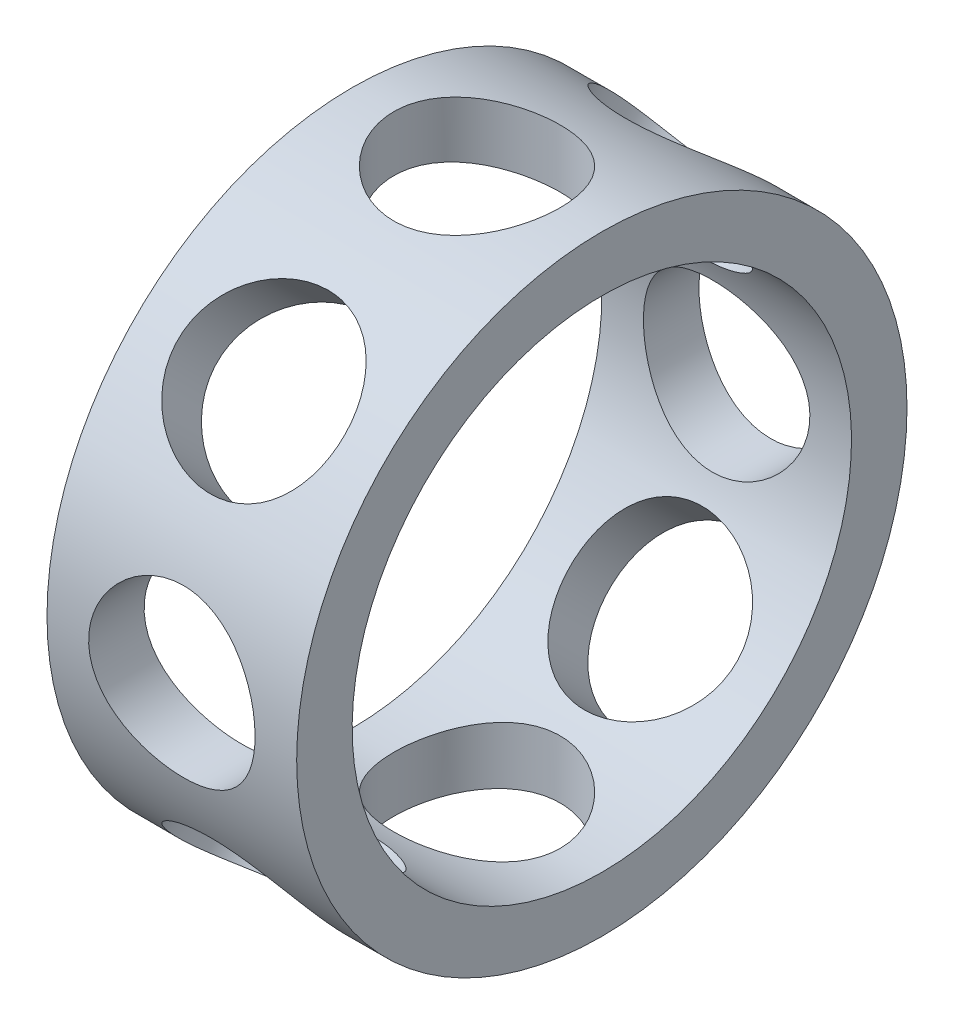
ISO-10303-21;
HEADER;
FILE_DESCRIPTION(('STEP AP214'),'2;1');
FILE_NAME('part.step','',(''),(''),'','','');
FILE_SCHEMA(('AUTOMOTIVE_DESIGN { 1 0 10303 214 1 1 1 1 }'));
ENDSEC;
DATA;
#1=APPLICATION_CONTEXT('core data for automotive mechanical design processes');
#2=APPLICATION_PROTOCOL_DEFINITION('international standard','automotive_design',2000,#1);
#3=PRODUCT_CONTEXT('',#1,'mechanical');
#4=PRODUCT('Part','Part','',(#3));
#5=PRODUCT_RELATED_PRODUCT_CATEGORY('part','',(#4));
#6=PRODUCT_DEFINITION_FORMATION('','',#4);
#7=PRODUCT_DEFINITION_CONTEXT('part definition',#1,'design');
#8=PRODUCT_DEFINITION('design','',#6,#7);
#9=PRODUCT_DEFINITION_SHAPE('','',#8);
#10=(LENGTH_UNIT() NAMED_UNIT(*) SI_UNIT(.MILLI.,.METRE.));
#11=(NAMED_UNIT(*) PLANE_ANGLE_UNIT() SI_UNIT($,.RADIAN.));
#12=(NAMED_UNIT(*) SI_UNIT($,.STERADIAN.) SOLID_ANGLE_UNIT());
#13=UNCERTAINTY_MEASURE_WITH_UNIT(LENGTH_MEASURE(1.E-05),#10,'distance_accuracy_value','');
#14=(GEOMETRIC_REPRESENTATION_CONTEXT(3) GLOBAL_UNCERTAINTY_ASSIGNED_CONTEXT((#13)) GLOBAL_UNIT_ASSIGNED_CONTEXT((#10,
#11,#12)) REPRESENTATION_CONTEXT('',''));
#15=CARTESIAN_POINT('',(0.,0.,0.));
#16=DIRECTION('',(0.,0.,1.));
#17=DIRECTION('',(1.,0.,0.));
#18=AXIS2_PLACEMENT_3D('',#15,#16,#17);
#19=CARTESIAN_POINT('',(-2.25,4.5,0.));
#20=DIRECTION('',(1.,0.,0.));
#21=DIRECTION('',(0.,1.,0.));
#22=AXIS2_PLACEMENT_3D('',#19,#20,#21);
#23=PLANE('',#22);
#24=CARTESIAN_POINT('',(-2.25,0.,0.));
#25=DIRECTION('',(-1.,0.,0.));
#26=DIRECTION('',(0.,-1.,0.));
#27=AXIS2_PLACEMENT_3D('',#24,#25,#26);
#28=CIRCLE('',#27,4.5);
#29=CARTESIAN_POINT('',(-2.25,-4.5,0.));
#30=VERTEX_POINT('',#29);
#31=EDGE_CURVE('E45',#30,#30,#28,.T.);
#32=ORIENTED_EDGE('',*,*,#31,.F.);
#33=EDGE_LOOP('',(#32));
#34=FACE_BOUND('',#33,.T.);
#35=CARTESIAN_POINT('',(-2.25,0.,0.));
#36=DIRECTION('',(-1.,0.,0.));
#37=DIRECTION('',(0.,-1.,0.));
#38=AXIS2_PLACEMENT_3D('',#35,#36,#37);
#39=CIRCLE('',#38,5.5);
#40=CARTESIAN_POINT('',(-2.25,-5.5,0.));
#41=VERTEX_POINT('',#40);
#42=EDGE_CURVE('E10',#41,#41,#39,.T.);
#43=ORIENTED_EDGE('',*,*,#42,.T.);
#44=EDGE_LOOP('',(#43));
#45=FACE_BOUND('',#44,.T.);
#46=ADVANCED_FACE('F31',(#34,#45),#23,.F.);
#47=CARTESIAN_POINT('',(-2.25,0.,0.));
#48=DIRECTION('',(-1.,0.,0.));
#49=DIRECTION('',(0.,-1.,0.));
#50=AXIS2_PLACEMENT_3D('',#47,#48,#49);
#51=CYLINDRICAL_SURFACE('',#50,5.5);
#52=CARTESIAN_POINT('',(0.,-4.8023175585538,-2.68099721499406));
#53=CARTESIAN_POINT('',(-0.082556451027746,-4.80231721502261,-2.68099947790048));
#54=CARTESIAN_POINT('',(-0.165132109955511,-4.79886289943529,-2.68721405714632));
#55=CARTESIAN_POINT('',(-0.327893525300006,-4.78504569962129,-2.7117391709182));
#56=CARTESIAN_POINT('',(-0.408078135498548,-4.7746795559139,-2.7300554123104));
#57=CARTESIAN_POINT('',(-0.563679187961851,-4.74706515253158,-2.77779151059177));
#58=CARTESIAN_POINT('',(-0.639102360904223,-4.72982687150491,-2.80719526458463));
#59=CARTESIAN_POINT('',(-0.783358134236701,-4.68848211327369,-2.87571383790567));
#60=CARTESIAN_POINT('',(-0.852190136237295,-4.6643750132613,-2.91482953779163));
#61=CARTESIAN_POINT('',(-0.983110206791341,-4.60867997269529,-3.00213356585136));
#62=CARTESIAN_POINT('',(-1.04500032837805,-4.57692862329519,-3.05051454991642));
#63=CARTESIAN_POINT('',(-1.15852765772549,-4.50640221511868,-3.15376630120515));
#64=CARTESIAN_POINT('',(-1.21016376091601,-4.46762640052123,-3.20863776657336));
#65=CARTESIAN_POINT('',(-1.30254862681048,-4.38266219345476,-3.32377319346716));
#66=CARTESIAN_POINT('',(-1.34309972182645,-4.3363601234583,-3.38411231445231));
#67=CARTESIAN_POINT('',(-1.41087286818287,-4.23749926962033,-3.50710928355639));
#68=CARTESIAN_POINT('',(-1.43809727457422,-4.18494159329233,-3.56976671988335));
#69=CARTESIAN_POINT('',(-1.47780109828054,-4.07599401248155,-3.69363103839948));
#70=CARTESIAN_POINT('',(-1.49061744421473,-4.01972575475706,-3.75483678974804));
#71=CARTESIAN_POINT('',(-1.50220230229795,-3.90374554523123,-3.87527477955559));
#72=CARTESIAN_POINT('',(-1.50097326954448,-3.84403419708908,-3.93450736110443));
#73=CARTESIAN_POINT('',(-1.4847376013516,-3.72458739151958,-4.04772113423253));
#74=CARTESIAN_POINT('',(-1.47009512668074,-3.66489408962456,-4.10179961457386));
#75=CARTESIAN_POINT('',(-1.42803766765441,-3.54584559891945,-4.20513924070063));
#76=CARTESIAN_POINT('',(-1.40062193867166,-3.48649043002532,-4.25440010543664));
#77=CARTESIAN_POINT('',(-1.33352286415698,-3.36947528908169,-4.3476772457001));
#78=CARTESIAN_POINT('',(-1.2937165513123,-3.31183895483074,-4.39163453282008));
#79=CARTESIAN_POINT('',(-1.2030611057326,-3.20088403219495,-4.47315194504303));
#80=CARTESIAN_POINT('',(-1.15220973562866,-3.14756632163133,-4.51071077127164));
#81=CARTESIAN_POINT('',(-1.03898200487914,-3.04555519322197,-4.58023252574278));
#82=CARTESIAN_POINT('',(-0.976288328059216,-2.99706492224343,-4.61197735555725));
#83=CARTESIAN_POINT('',(-0.842154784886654,-2.90871996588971,-4.66820070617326));
#84=CARTESIAN_POINT('',(-0.770714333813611,-2.86886585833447,-4.69267874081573));
#85=CARTESIAN_POINT('',(-0.620445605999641,-2.79937540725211,-4.73446510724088));
#86=CARTESIAN_POINT('',(-0.541570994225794,-2.769809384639,-4.75172425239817));
#87=CARTESIAN_POINT('',(-0.379077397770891,-2.72280719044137,-4.77881419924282));
#88=CARTESIAN_POINT('',(-0.295459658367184,-2.70536785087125,-4.78864694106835));
#89=CARTESIAN_POINT('',(-0.128647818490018,-2.68393656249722,-4.80069078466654));
#90=CARTESIAN_POINT('',(-0.0455218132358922,-2.67954224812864,-4.80312998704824));
#91=CARTESIAN_POINT('',(0.120351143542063,-2.68329924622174,-4.80103219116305));
#92=CARTESIAN_POINT('',(0.203098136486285,-2.69144915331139,-4.79649597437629));
#93=CARTESIAN_POINT('',(0.364122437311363,-2.71954811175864,-4.78061783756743));
#94=CARTESIAN_POINT('',(0.442456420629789,-2.73925384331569,-4.76941619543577));
#95=CARTESIAN_POINT('',(0.594346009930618,-2.78927900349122,-4.74033272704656));
#96=CARTESIAN_POINT('',(0.667900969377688,-2.8195998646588,-4.72244999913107));
#97=CARTESIAN_POINT('',(0.810000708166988,-2.89028006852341,-4.67953233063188));
#98=CARTESIAN_POINT('',(0.878392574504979,-2.9308529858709,-4.6543432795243));
#99=CARTESIAN_POINT('',(1.00656606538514,-3.01994219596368,-4.59703697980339));
#100=CARTESIAN_POINT('',(1.06634599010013,-3.06846005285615,-4.56491836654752));
#101=CARTESIAN_POINT('',(1.1774663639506,-3.17313481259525,-4.4928129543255));
#102=CARTESIAN_POINT('',(1.2284950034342,-3.22947910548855,-4.45261664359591));
#103=CARTESIAN_POINT('',(1.31837063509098,-3.34644224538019,-4.36539097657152));
#104=CARTESIAN_POINT('',(1.35721827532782,-3.407060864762,-4.3183619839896));
#105=CARTESIAN_POINT('',(1.42126706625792,-3.52985682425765,-4.21856799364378));
#106=CARTESIAN_POINT('',(1.44657089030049,-3.59201858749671,-4.16584990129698));
#107=CARTESIAN_POINT('',(1.48310695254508,-3.7161306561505,-4.05552192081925));
#108=CARTESIAN_POINT('',(1.49434246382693,-3.77808100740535,-3.99791317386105));
#109=CARTESIAN_POINT('',(1.50221012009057,-3.89774355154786,-3.88128250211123));
#110=CARTESIAN_POINT('',(1.49929867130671,-3.95552794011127,-3.82236501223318));
#111=CARTESIAN_POINT('',(1.48002022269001,-4.06732640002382,-3.70317870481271));
#112=CARTESIAN_POINT('',(1.46365377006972,-4.12134062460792,-3.64290994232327));
#113=CARTESIAN_POINT('',(1.41819262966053,-4.22393994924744,-3.5234205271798));
#114=CARTESIAN_POINT('',(1.38919430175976,-4.27256272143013,-3.46419540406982));
#115=CARTESIAN_POINT('',(1.3193783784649,-4.36399561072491,-3.3482828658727));
#116=CARTESIAN_POINT('',(1.27855906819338,-4.40680488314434,-3.29159582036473));
#117=CARTESIAN_POINT('',(1.1849452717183,-4.48719112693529,-3.18118091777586));
#118=CARTESIAN_POINT('',(1.13185092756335,-4.52459073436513,-3.12757819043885));
#119=CARTESIAN_POINT('',(1.01575786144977,-4.59243113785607,-3.02708769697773));
#120=CARTESIAN_POINT('',(0.952756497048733,-4.62287007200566,-2.98020172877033));
#121=CARTESIAN_POINT('',(0.816872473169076,-4.67729550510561,-2.89405753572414));
#122=CARTESIAN_POINT('',(0.743793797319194,-4.70111515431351,-2.85500247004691));
#123=CARTESIAN_POINT('',(0.590914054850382,-4.74128858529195,-2.78778156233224));
#124=CARTESIAN_POINT('',(0.511117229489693,-4.75764703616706,-2.75960891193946));
#125=CARTESIAN_POINT('',(0.359731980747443,-4.7809546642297,-2.71899436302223));
#126=CARTESIAN_POINT('',(0.288771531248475,-4.78896480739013,-2.70479824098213));
#127=CARTESIAN_POINT('',(0.145212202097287,-4.79964606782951,-2.6857992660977));
#128=CARTESIAN_POINT('',(0.0726135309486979,-4.80231786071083,-2.68099522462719));
#129=CARTESIAN_POINT('',(0.,-4.8023175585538,-2.68099721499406));
#130=B_SPLINE_CURVE_WITH_KNOTS('',3,(#52,#53,#54,#55,#56,#57,#58,#59,#60,#61,#62,#63,#64,#65,
#66,#67,#68,#69,#70,#71,#72,#73,#74,#75,#76,#77,#78,#79,#80,#81,#82,#83,#84,#85,#86,#87,#88,#89,
#90,#91,#92,#93,#94,#95,#96,#97,#98,#99,#100,#101,#102,#103,#104,#105,#106,#107,#108,#109,#110,
#111,#112,#113,#114,#115,#116,#117,#118,#119,#120,#121,#122,#123,#124,#125,#126,#127,#128,#129),
.UNSPECIFIED.,.T.,.F.,(4,2,2,2,2,2,2,2,2,2,2,2,2,2,2,2,2,2,2,2,2,2,2,2,2,2,2,2,2,2,2,2,2,2,2,2,
2,2,4),(0.,0.247402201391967,0.494921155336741,0.742082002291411,0.989265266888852,
1.24229327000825,1.49534851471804,1.75265882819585,2.00992365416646,2.26103843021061,
2.51210931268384,2.75655962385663,3.0010241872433,3.24799669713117,3.49501928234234,
3.74996416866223,4.00492610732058,4.26159801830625,4.51820285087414,4.76680611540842,
5.01538153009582,5.25890187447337,5.50245509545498,5.75157425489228,6.00074251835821,
6.25748556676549,6.51421495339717,6.76896951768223,7.02366480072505,7.27019876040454,
7.51672269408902,7.76139812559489,8.00610907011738,8.25758505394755,8.50912822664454,
8.76653181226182,9.02377409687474,9.24140725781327,9.45901287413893),.UNSPECIFIED.);
#131=CARTESIAN_POINT('',(0.,-4.8023175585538,-2.68099721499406));
#132=VERTEX_POINT('',#131);
#133=EDGE_CURVE('E179',#132,#132,#130,.T.);
#134=ORIENTED_EDGE('',*,*,#133,.F.);
#135=EDGE_LOOP('',(#134));
#136=FACE_BOUND('',#135,.T.);
#137=CARTESIAN_POINT('',(0.,-1.50000000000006,-5.29150262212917));
#138=CARTESIAN_POINT('',(-0.0825564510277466,-1.49999815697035,-5.29150397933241));
#139=CARTESIAN_POINT('',(-0.165132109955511,-1.49316121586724,-5.29345578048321));
#140=CARTESIAN_POINT('',(-0.327893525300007,-1.46604910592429,-5.30102741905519));
#141=CARTESIAN_POINT('',(-0.408078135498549,-1.44576759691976,-5.30664898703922));
#142=CARTESIAN_POINT('',(-0.563679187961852,-1.39248674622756,-5.3208771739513));
#143=CARTESIAN_POINT('',(-0.639102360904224,-1.35950584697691,-5.32947946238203));
#144=CARTESIAN_POINT('',(-0.783358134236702,-1.28182074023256,-5.34869425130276));
#145=CARTESIAN_POINT('',(-0.852190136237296,-1.23711546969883,-5.35930693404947));
#146=CARTESIAN_POINT('',(-0.983110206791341,-1.13599985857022,-5.38165786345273));
#147=CARTESIAN_POINT('',(-1.04500032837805,-1.0793377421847,-5.39341679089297));
#148=CARTESIAN_POINT('',(-1.15852765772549,-0.956458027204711,-5.41655710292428));
#149=CARTESIAN_POINT('',(-1.21016376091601,-0.890239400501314,-5.42793844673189));
#150=CARTESIAN_POINT('',(-1.30254862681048,-0.748747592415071,-5.44927272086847));
#151=CARTESIAN_POINT('',(-1.34309972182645,-0.673340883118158,-5.45919841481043));
#152=CARTESIAN_POINT('',(-1.41087286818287,-0.516463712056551,-5.4762652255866));
#153=CARTESIAN_POINT('',(-1.43809727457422,-0.434994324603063,-5.48340683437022));
#154=CARTESIAN_POINT('',(-1.47780109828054,-0.270371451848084,-5.49395456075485));
#155=CARTESIAN_POINT('',(-1.49061744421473,-0.187304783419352,-5.4974458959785));
#156=CARTESIAN_POINT('',(-1.50220230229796,-0.0201318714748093,-5.50059802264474));
#157=CARTESIAN_POINT('',(-1.50097326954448,0.0639741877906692,-5.50025948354));
#158=CARTESIAN_POINT('',(-1.4847376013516,0.228490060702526,-5.49585206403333));
#159=CARTESIAN_POINT('',(-1.47009512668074,0.308938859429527,-5.49188178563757));
#160=CARTESIAN_POINT('',(-1.42803766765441,0.466191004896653,-5.48077394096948));
#161=CARTESIAN_POINT('',(-1.40062193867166,0.542994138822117,-5.47363619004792));
#162=CARTESIAN_POINT('',(-1.33352286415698,0.691693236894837,-5.45685088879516));
#163=CARTESIAN_POINT('',(-1.2937165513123,0.763530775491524,-5.44717834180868));
#164=CARTESIAN_POINT('',(-1.2030611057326,0.899629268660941,-5.42636287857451));
#165=CARTESIAN_POINT('',(-1.15220973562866,0.963888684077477,-5.41521966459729));
#166=CARTESIAN_POINT('',(-1.03898200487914,1.08518074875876,-5.39224620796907));
#167=CARTESIAN_POINT('',(-0.976288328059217,1.14191553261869,-5.38040539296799));
#168=CARTESIAN_POINT('',(-0.842154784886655,1.24414076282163,-5.35769198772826));
#169=CARTESIAN_POINT('',(-0.770714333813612,1.2896304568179,-5.34681946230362));
#170=CARTESIAN_POINT('',(-0.620445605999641,1.36831504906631,-5.32722971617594));
#171=CARTESIAN_POINT('',(-0.541570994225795,1.40142544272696,-5.3185274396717));
#172=CARTESIAN_POINT('',(-0.379077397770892,1.45381649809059,-5.30444735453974));
#173=CARTESIAN_POINT('',(-0.295459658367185,1.47310077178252,-5.29906867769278));
#174=CARTESIAN_POINT('',(-0.128647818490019,1.4967712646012,-5.29243075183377));
#175=CARTESIAN_POINT('',(-0.0455218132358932,1.50160329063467,-5.29104827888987));
#176=CARTESIAN_POINT('',(0.120351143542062,1.49746332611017,-5.29222151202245));
#177=CARTESIAN_POINT('',(0.203098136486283,1.48849288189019,-5.29477677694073));
#178=CARTESIAN_POINT('',(0.364122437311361,1.4573963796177,-5.3034182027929));
#179=CARTESIAN_POINT('',(0.442456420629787,1.43554156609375,-5.30943150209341));
#180=CARTESIAN_POINT('',(0.594346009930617,1.37960331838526,-5.32423951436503));
#181=CARTESIAN_POINT('',(0.667900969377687,1.34551823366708,-5.33303460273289));
#182=CARTESIAN_POINT('',(0.810000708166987,1.26519240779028,-5.35266567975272));
#183=CARTESIAN_POINT('',(0.878392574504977,1.21869167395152,-5.36354371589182));
#184=CARTESIAN_POINT('',(1.00656606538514,1.115174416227,-5.38601762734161));
#185=CARTESIAN_POINT('',(1.06634599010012,1.05815582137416,-5.39761364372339));
#186=CARTESIAN_POINT('',(1.1774663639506,0.933153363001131,-5.42064365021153));
#187=CARTESIAN_POINT('',(1.2284950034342,0.864888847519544,-5.43206199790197));
#188=CARTESIAN_POINT('',(1.31837063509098,0.72050555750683,-5.45308956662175));
#189=CARTESIAN_POINT('',(1.35721827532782,0.644387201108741,-5.46269888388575));
#190=CARTESIAN_POINT('',(1.42126706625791,0.486992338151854,-5.47896373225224));
#191=CARTESIAN_POINT('',(1.44657089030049,0.405760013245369,-5.48564141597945));
#192=CARTESIAN_POINT('',(1.48310695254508,0.239985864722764,-5.49538823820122));
#193=CARTESIAN_POINT('',(1.49434246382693,0.155444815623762,-5.49845821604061));
#194=CARTESIAN_POINT('',(1.50221012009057,-0.0116397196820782,-5.50060207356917));
#195=CARTESIAN_POINT('',(1.49929867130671,-0.0941604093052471,-5.49980084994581));
#196=CARTESIAN_POINT('',(1.48002022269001,-0.257491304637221,-5.49457685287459));
#197=CARTESIAN_POINT('',(1.46365377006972,-0.338301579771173,-5.49015422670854));
#198=CARTESIAN_POINT('',(1.41819262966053,-0.495342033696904,-5.47821112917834));
#199=CARTESIAN_POINT('',(1.38919430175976,-0.571602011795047,-5.47071413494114));
#200=CARTESIAN_POINT('',(1.31937837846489,-0.718217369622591,-5.45340440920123));
#201=CARTESIAN_POINT('',(1.27855906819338,-0.788571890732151,-5.44359134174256));
#202=CARTESIAN_POINT('',(1.1849452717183,-0.923488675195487,-5.4223578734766));
#203=CARTESIAN_POINT('',(1.13185092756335,-0.987837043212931,-5.41090053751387));
#204=CARTESIAN_POINT('',(1.01575786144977,-1.10686496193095,-5.3878134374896));
#205=CARTESIAN_POINT('',(0.952756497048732,-1.16154192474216,-5.37618362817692));
#206=CARTESIAN_POINT('',(0.816872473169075,-1.26093966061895,-5.3537550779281));
#207=CARTESIAN_POINT('',(0.743793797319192,-1.3053987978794,-5.34298201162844));
#208=CARTESIAN_POINT('',(0.590914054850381,-1.38133806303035,-5.32385655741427));
#209=CARTESIAN_POINT('',(0.511117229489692,-1.41282630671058,-5.31550265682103));
#210=CARTESIAN_POINT('',(0.359731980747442,-1.45802611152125,-5.30326481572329));
#211=CARTESIAN_POINT('',(0.288771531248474,-1.47372831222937,-5.2988906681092));
#212=CARTESIAN_POINT('',(0.145212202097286,-1.49471540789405,-5.29300915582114));
#213=CARTESIAN_POINT('',(0.0726135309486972,-1.50000162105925,-5.29150142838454));
#214=CARTESIAN_POINT('',(0.,-1.50000000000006,-5.29150262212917));
#215=B_SPLINE_CURVE_WITH_KNOTS('',3,(#137,#138,#139,#140,#141,#142,#143,#144,#145,#146,#147,
#148,#149,#150,#151,#152,#153,#154,#155,#156,#157,#158,#159,#160,#161,#162,#163,#164,#165,#166,
#167,#168,#169,#170,#171,#172,#173,#174,#175,#176,#177,#178,#179,#180,#181,#182,#183,#184,#185,
#186,#187,#188,#189,#190,#191,#192,#193,#194,#195,#196,#197,#198,#199,#200,#201,#202,#203,#204,
#205,#206,#207,#208,#209,#210,#211,#212,#213,#214),.UNSPECIFIED.,.T.,.F.,(4,2,2,2,2,2,2,2,2,2,2,
2,2,2,2,2,2,2,2,2,2,2,2,2,2,2,2,2,2,2,2,2,2,2,2,2,2,2,4),(0.,0.247402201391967,
0.494921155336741,0.742082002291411,0.989265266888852,1.24229327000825,1.49534851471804,
1.75265882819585,2.00992365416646,2.26103843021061,2.51210931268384,2.75655962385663,
3.0010241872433,3.24799669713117,3.49501928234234,3.74996416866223,4.00492610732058,
4.26159801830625,4.51820285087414,4.76680611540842,5.01538153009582,5.25890187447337,
5.50245509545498,5.75157425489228,6.0007425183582,6.25748556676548,6.51421495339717,
6.76896951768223,7.02366480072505,7.27019876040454,7.51672269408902,7.76139812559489,
8.00610907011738,8.25758505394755,8.50912822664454,8.76653181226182,9.02377409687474,
9.24140725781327,9.45901287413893),.UNSPECIFIED.);
#216=CARTESIAN_POINT('',(0.,-1.50000000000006,-5.29150262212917));
#217=VERTEX_POINT('',#216);
#218=EDGE_CURVE('E172',#217,#217,#215,.T.);
#219=ORIENTED_EDGE('',*,*,#218,.F.);
#220=EDGE_LOOP('',(#219));
#221=FACE_BOUND('',#220,.T.);
#222=CARTESIAN_POINT('',(0.,2.68099721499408,-4.80231755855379));
#223=CARTESIAN_POINT('',(-0.0825564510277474,2.68099947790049,-4.8023172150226));
#224=CARTESIAN_POINT('',(-0.165132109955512,2.68721405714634,-4.79886289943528));
#225=CARTESIAN_POINT('',(-0.327893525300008,2.71173917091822,-4.78504569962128));
#226=CARTESIAN_POINT('',(-0.40807813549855,2.73005541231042,-4.77467955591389));
#227=CARTESIAN_POINT('',(-0.563679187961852,2.77779151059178,-4.74706515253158));
#228=CARTESIAN_POINT('',(-0.639102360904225,2.80719526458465,-4.7298268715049));
#229=CARTESIAN_POINT('',(-0.783358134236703,2.87571383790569,-4.68848211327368));
#230=CARTESIAN_POINT('',(-0.852190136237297,2.91482953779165,-4.66437501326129));
#231=CARTESIAN_POINT('',(-0.983110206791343,3.00213356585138,-4.60867997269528));
#232=CARTESIAN_POINT('',(-1.04500032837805,3.05051454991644,-4.57692862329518));
#233=CARTESIAN_POINT('',(-1.15852765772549,3.15376630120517,-4.50640221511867));
#234=CARTESIAN_POINT('',(-1.21016376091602,3.20863776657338,-4.46762640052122));
#235=CARTESIAN_POINT('',(-1.30254862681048,3.32377319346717,-4.38266219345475));
#236=CARTESIAN_POINT('',(-1.34309972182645,3.38411231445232,-4.33636012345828));
#237=CARTESIAN_POINT('',(-1.41087286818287,3.50710928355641,-4.23749926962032));
#238=CARTESIAN_POINT('',(-1.43809727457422,3.56976671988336,-4.18494159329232));
#239=CARTESIAN_POINT('',(-1.47780109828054,3.69363103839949,-4.07599401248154));
#240=CARTESIAN_POINT('',(-1.49061744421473,3.75483678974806,-4.01972575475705));
#241=CARTESIAN_POINT('',(-1.50220230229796,3.8752747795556,-3.90374554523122));
#242=CARTESIAN_POINT('',(-1.50097326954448,3.93450736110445,-3.84403419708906));
#243=CARTESIAN_POINT('',(-1.48473760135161,4.04772113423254,-3.72458739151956));
#244=CARTESIAN_POINT('',(-1.47009512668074,4.10179961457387,-3.66489408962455));
#245=CARTESIAN_POINT('',(-1.42803766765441,4.20513924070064,-3.54584559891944));
#246=CARTESIAN_POINT('',(-1.40062193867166,4.25440010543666,-3.4864904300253));
#247=CARTESIAN_POINT('',(-1.33352286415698,4.34767724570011,-3.36947528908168));
#248=CARTESIAN_POINT('',(-1.2937165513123,4.39163453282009,-3.31183895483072));
#249=CARTESIAN_POINT('',(-1.2030611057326,4.47315194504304,-3.20088403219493));
#250=CARTESIAN_POINT('',(-1.15220973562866,4.51071077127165,-3.14756632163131));
#251=CARTESIAN_POINT('',(-1.03898200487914,4.58023252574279,-3.04555519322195));
#252=CARTESIAN_POINT('',(-0.976288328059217,4.61197735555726,-2.99706492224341));
#253=CARTESIAN_POINT('',(-0.842154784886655,4.66820070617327,-2.9087199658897));
#254=CARTESIAN_POINT('',(-0.770714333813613,4.69267874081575,-2.86886585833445));
#255=CARTESIAN_POINT('',(-0.620445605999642,4.73446510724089,-2.7993754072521));
#256=CARTESIAN_POINT('',(-0.541570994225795,4.75172425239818,-2.76980938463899));
#257=CARTESIAN_POINT('',(-0.379077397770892,4.77881419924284,-2.72280719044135));
#258=CARTESIAN_POINT('',(-0.295459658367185,4.78864694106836,-2.70536785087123));
#259=CARTESIAN_POINT('',(-0.128647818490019,4.80069078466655,-2.6839365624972));
#260=CARTESIAN_POINT('',(-0.045521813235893,4.80312998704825,-2.67954224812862));
#261=CARTESIAN_POINT('',(0.120351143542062,4.80103219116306,-2.68329924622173));
#262=CARTESIAN_POINT('',(0.203098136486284,4.7964959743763,-2.69144915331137));
#263=CARTESIAN_POINT('',(0.364122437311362,4.78061783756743,-2.71954811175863));
#264=CARTESIAN_POINT('',(0.442456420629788,4.76941619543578,-2.73925384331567));
#265=CARTESIAN_POINT('',(0.594346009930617,4.74033272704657,-2.7892790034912));
#266=CARTESIAN_POINT('',(0.667900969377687,4.72244999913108,-2.81959986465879));
#267=CARTESIAN_POINT('',(0.810000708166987,4.67953233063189,-2.8902800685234));
#268=CARTESIAN_POINT('',(0.878392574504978,4.65434327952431,-2.93085298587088));
#269=CARTESIAN_POINT('',(1.00656606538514,4.5970369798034,-3.01994219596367));
#270=CARTESIAN_POINT('',(1.06634599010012,4.56491836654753,-3.06846005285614));
#271=CARTESIAN_POINT('',(1.1774663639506,4.49281295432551,-3.17313481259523));
#272=CARTESIAN_POINT('',(1.2284950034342,4.45261664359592,-3.22947910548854));
#273=CARTESIAN_POINT('',(1.31837063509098,4.36539097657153,-3.34644224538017));
#274=CARTESIAN_POINT('',(1.35721827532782,4.31836198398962,-3.40706086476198));
#275=CARTESIAN_POINT('',(1.42126706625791,4.21856799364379,-3.52985682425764));
#276=CARTESIAN_POINT('',(1.44657089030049,4.16584990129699,-3.5920185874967));
#277=CARTESIAN_POINT('',(1.48310695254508,4.05552192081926,-3.71613065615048));
#278=CARTESIAN_POINT('',(1.49434246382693,3.99791317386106,-3.77808100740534));
#279=CARTESIAN_POINT('',(1.50221012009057,3.88128250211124,-3.89774355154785));
#280=CARTESIAN_POINT('',(1.49929867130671,3.82236501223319,-3.95552794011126));
#281=CARTESIAN_POINT('',(1.48002022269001,3.70317870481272,-4.06732640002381));
#282=CARTESIAN_POINT('',(1.46365377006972,3.64290994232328,-4.12134062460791));
#283=CARTESIAN_POINT('',(1.41819262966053,3.52342052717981,-4.22393994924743));
#284=CARTESIAN_POINT('',(1.38919430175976,3.46419540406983,-4.27256272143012));
#285=CARTESIAN_POINT('',(1.31937837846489,3.34828286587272,-4.3639956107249));
#286=CARTESIAN_POINT('',(1.27855906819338,3.29159582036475,-4.40680488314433));
#287=CARTESIAN_POINT('',(1.1849452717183,3.18118091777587,-4.48719112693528));
#288=CARTESIAN_POINT('',(1.13185092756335,3.12757819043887,-4.52459073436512));
#289=CARTESIAN_POINT('',(1.01575786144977,3.02708769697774,-4.59243113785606));
#290=CARTESIAN_POINT('',(0.952756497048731,2.98020172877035,-4.62287007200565));
#291=CARTESIAN_POINT('',(0.816872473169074,2.89405753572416,-4.6772955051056));
#292=CARTESIAN_POINT('',(0.743793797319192,2.85500247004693,-4.7011151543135));
#293=CARTESIAN_POINT('',(0.59091405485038,2.78778156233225,-4.74128858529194));
#294=CARTESIAN_POINT('',(0.51111722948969,2.75960891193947,-4.75764703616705));
#295=CARTESIAN_POINT('',(0.35973198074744,2.71899436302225,-4.78095466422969));
#296=CARTESIAN_POINT('',(0.288771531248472,2.70479824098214,-4.78896480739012));
#297=CARTESIAN_POINT('',(0.145212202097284,2.68579926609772,-4.7996460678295));
#298=CARTESIAN_POINT('',(0.072613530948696,2.68099522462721,-4.80231786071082));
#299=CARTESIAN_POINT('',(0.,2.68099721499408,-4.80231755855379));
#300=B_SPLINE_CURVE_WITH_KNOTS('',3,(#222,#223,#224,#225,#226,#227,#228,#229,#230,#231,#232,
#233,#234,#235,#236,#237,#238,#239,#240,#241,#242,#243,#244,#245,#246,#247,#248,#249,#250,#251,
#252,#253,#254,#255,#256,#257,#258,#259,#260,#261,#262,#263,#264,#265,#266,#267,#268,#269,#270,
#271,#272,#273,#274,#275,#276,#277,#278,#279,#280,#281,#282,#283,#284,#285,#286,#287,#288,#289,
#290,#291,#292,#293,#294,#295,#296,#297,#298,#299),.UNSPECIFIED.,.T.,.F.,(4,2,2,2,2,2,2,2,2,2,2,
2,2,2,2,2,2,2,2,2,2,2,2,2,2,2,2,2,2,2,2,2,2,2,2,2,2,2,4),(0.,0.247402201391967,
0.494921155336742,0.742082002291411,0.989265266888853,1.24229327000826,1.49534851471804,
1.75265882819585,2.00992365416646,2.26103843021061,2.51210931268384,2.75655962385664,
3.0010241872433,3.24799669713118,3.49501928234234,3.74996416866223,4.00492610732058,
4.26159801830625,4.51820285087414,4.76680611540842,5.01538153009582,5.25890187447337,
5.50245509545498,5.75157425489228,6.00074251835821,6.25748556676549,6.51421495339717,
6.76896951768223,7.02366480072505,7.27019876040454,7.51672269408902,7.76139812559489,
8.00610907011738,8.25758505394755,8.50912822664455,8.76653181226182,9.02377409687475,
9.24140725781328,9.45901287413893),.UNSPECIFIED.);
#301=CARTESIAN_POINT('',(0.,2.68099721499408,-4.80231755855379));
#302=VERTEX_POINT('',#301);
#303=EDGE_CURVE('E138',#302,#302,#300,.T.);
#304=ORIENTED_EDGE('',*,*,#303,.F.);
#305=EDGE_LOOP('',(#304));
#306=FACE_BOUND('',#305,.T.);
#307=CARTESIAN_POINT('',(1.5,5.5,0.));
#308=CARTESIAN_POINT('',(1.49999818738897,5.49999882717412,-0.0826209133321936));
#309=CARTESIAN_POINT('',(1.49315093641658,5.49812007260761,-0.165260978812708));
#310=CARTESIAN_POINT('',(1.46599416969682,5.49080798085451,-0.328155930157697));
#311=CARTESIAN_POINT('',(1.4456786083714,5.48537304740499,-0.408409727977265));
#312=CARTESIAN_POINT('',(1.39229826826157,5.47154772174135,-0.564157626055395));
#313=CARTESIAN_POINT('',(1.35925034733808,5.46316123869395,-0.639657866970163));
#314=CARTESIAN_POINT('',(1.28140706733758,5.44431654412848,-0.78404449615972));
#315=CARTESIAN_POINT('',(1.23661078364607,5.43385816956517,-0.852930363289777));
#316=CARTESIAN_POINT('',(1.13540016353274,5.41171397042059,-0.983796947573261));
#317=CARTESIAN_POINT('',(1.0787545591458,5.4000064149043,-1.04559512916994));
#318=CARTESIAN_POINT('',(0.955947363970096,5.37682112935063,-1.15894293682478));
#319=CARTESIAN_POINT('',(0.889784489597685,5.36534343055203,-1.21049117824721));
#320=CARTESIAN_POINT('',(0.748348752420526,5.34369384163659,-1.30277794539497));
#321=CARTESIAN_POINT('',(0.67293285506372,5.33354930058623,-1.34330426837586));
#322=CARTESIAN_POINT('',(0.516036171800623,5.31603507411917,-1.41102916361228));
#323=CARTESIAN_POINT('',(0.434556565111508,5.30866485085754,-1.43823031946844));
#324=CARTESIAN_POINT('',(0.26987210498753,5.2977584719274,-1.47789456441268));
#325=CARTESIAN_POINT('',(0.18675305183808,5.29413612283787,-1.49068960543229));
#326=CARTESIAN_POINT('',(0.0194753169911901,5.29087829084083,-1.50221364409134));
#327=CARTESIAN_POINT('',(-0.0646831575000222,5.2912420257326,-1.50094540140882));
#328=CARTESIAN_POINT('',(-0.22904155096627,5.29583824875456,-1.48464191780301));
#329=CARTESIAN_POINT('',(-0.309285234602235,5.29995718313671,-1.47001073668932));
#330=CARTESIAN_POINT('',(-0.466133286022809,5.31141755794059,-1.42804483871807));
#331=CARTESIAN_POINT('',(-0.542737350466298,5.31875926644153,-1.40070906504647));
#332=CARTESIAN_POINT('',(-0.691173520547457,5.33593618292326,-1.3337862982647));
#333=CARTESIAN_POINT('',(-0.762939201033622,5.34579959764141,-1.29405951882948));
#334=CARTESIAN_POINT('',(-0.898926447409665,5.36689368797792,-1.20357988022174));
#335=CARTESIAN_POINT('',(-0.963146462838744,5.37812464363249,-1.15282476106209));
#336=CARTESIAN_POINT('',(-1.08452518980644,5.40115894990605,-1.03967346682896));
#337=CARTESIAN_POINT('',(-1.14136744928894,5.41296874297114,-0.976938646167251));
#338=CARTESIAN_POINT('',(-1.24379096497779,5.43548647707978,-0.842682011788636));
#339=CARTESIAN_POINT('',(-1.28937173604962,5.44619437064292,-0.771159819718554));
#340=CARTESIAN_POINT('',(-1.36812667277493,5.46537278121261,-0.620853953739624));
#341=CARTESIAN_POINT('',(-1.40124133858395,5.47383251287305,-0.542037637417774));
#342=CARTESIAN_POINT('',(-1.45365797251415,5.48748356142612,-0.379672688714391));
#343=CARTESIAN_POINT('',(-1.47296310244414,5.49267562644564,-0.296125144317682));
#344=CARTESIAN_POINT('',(-1.49671061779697,5.49909228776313,-0.12936817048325));
#345=CARTESIAN_POINT('',(-1.50158299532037,5.50043163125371,-0.0462242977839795));
#346=CARTESIAN_POINT('',(-1.49751725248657,5.49932301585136,0.119693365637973));
#347=CARTESIAN_POINT('',(-1.48858063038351,5.49687546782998,0.202467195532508));
#348=CARTESIAN_POINT('',(-1.45750249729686,5.48854239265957,0.363745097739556));
#349=CARTESIAN_POINT('',(-1.43560280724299,5.48271986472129,0.442299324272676));
#350=CARTESIAN_POINT('',(-1.37950275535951,5.46829923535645,0.594609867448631));
#351=CARTESIAN_POINT('',(-1.34530103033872,5.45970082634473,0.668365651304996));
#352=CARTESIAN_POINT('',(-1.26478355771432,5.44041573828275,0.81064116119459));
#353=CARTESIAN_POINT('',(-1.21823651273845,5.4296902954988,0.879024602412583));
#354=CARTESIAN_POINT('',(-1.11463871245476,5.40738988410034,1.00716022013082));
#355=CARTESIAN_POINT('',(-1.05758578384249,5.39581474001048,1.06691060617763));
#356=CARTESIAN_POINT('',(-0.932585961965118,5.37269401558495,1.17791060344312));
#357=CARTESIAN_POINT('',(-0.864366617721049,5.36115944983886,1.22885627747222));
#358=CARTESIAN_POINT('',(-0.720101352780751,5.33980026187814,1.3185858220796));
#359=CARTESIAN_POINT('',(-0.644055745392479,5.32997557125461,1.35737017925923));
#360=CARTESIAN_POINT('',(-0.486659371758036,5.31326248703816,1.42138558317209));
#361=CARTESIAN_POINT('',(-0.405341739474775,5.30635748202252,1.44669352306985));
#362=CARTESIAN_POINT('',(-0.239383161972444,5.29626814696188,1.48320917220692));
#363=CARTESIAN_POINT('',(-0.154743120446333,5.29308281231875,1.49442068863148));
#364=CARTESIAN_POINT('',(0.0123384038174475,5.29088009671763,1.50219895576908));
#365=CARTESIAN_POINT('',(0.0947555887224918,5.29172336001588,1.49925533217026));
#366=CARTESIAN_POINT('',(0.257870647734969,5.29715501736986,1.47994837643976));
#367=CARTESIAN_POINT('',(0.338568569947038,5.30174330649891,1.46358542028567));
#368=CARTESIAN_POINT('',(0.495306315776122,5.31406316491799,1.41819408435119));
#369=CARTESIAN_POINT('',(0.571379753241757,5.32176783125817,1.38927395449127));
#370=CARTESIAN_POINT('',(0.717653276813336,5.33945189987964,1.31967304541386));
#371=CARTESIAN_POINT('',(0.787852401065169,5.34943167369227,1.27899034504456));
#372=CARTESIAN_POINT('',(0.922710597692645,5.37092379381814,1.18555430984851));
#373=CARTESIAN_POINT('',(0.98713370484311,5.38247375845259,1.13246901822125));
#374=CARTESIAN_POINT('',(1.1063164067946,5.40559990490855,1.01636011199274));
#375=CARTESIAN_POINT('',(1.16107362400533,5.41717609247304,0.953334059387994));
#376=CARTESIAN_POINT('',(1.2605946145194,5.43936459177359,0.817407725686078));
#377=CARTESIAN_POINT('',(1.30510348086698,5.44994907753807,0.744315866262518));
#378=CARTESIAN_POINT('',(1.38113243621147,5.46865263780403,0.591399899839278));
#379=CARTESIAN_POINT('',(1.41266048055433,5.47677322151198,0.51157995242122));
#380=CARTESIAN_POINT('',(1.45793950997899,5.48864193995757,0.36010010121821));
#381=CARTESIAN_POINT('',(1.4736745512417,5.49286947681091,0.289064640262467));
#382=CARTESIAN_POINT('',(1.49470502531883,5.49854887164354,0.145357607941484));
#383=CARTESIAN_POINT('',(1.5000015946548,5.5000010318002,0.0726862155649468));
#384=CARTESIAN_POINT('',(1.5,5.5,0.));
#385=B_SPLINE_CURVE_WITH_KNOTS('',3,(#307,#308,#309,#310,#311,#312,#313,#314,#315,#316,#317,
#318,#319,#320,#321,#322,#323,#324,#325,#326,#327,#328,#329,#330,#331,#332,#333,#334,#335,#336,
#337,#338,#339,#340,#341,#342,#343,#344,#345,#346,#347,#348,#349,#350,#351,#352,#353,#354,#355,
#356,#357,#358,#359,#360,#361,#362,#363,#364,#365,#366,#367,#368,#369,#370,#371,#372,#373,#374,
#375,#376,#377,#378,#379,#380,#381,#382,#383,#384),.UNSPECIFIED.,.T.,.F.,(4,2,2,2,2,2,2,2,2,2,2,
2,2,2,2,2,2,2,2,2,2,2,2,2,2,2,2,2,2,2,2,2,2,2,2,2,2,2,4),(0.,0.247596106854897,0.4953034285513,
0.742683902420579,0.990083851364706,1.24285878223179,1.49566783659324,1.75304593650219,
2.01037411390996,2.26164304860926,2.51286267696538,2.75672886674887,3.00061534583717,
3.24735926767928,3.49415380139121,3.74938528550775,4.00462776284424,4.26107349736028,
4.51746049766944,4.76612811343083,5.01476875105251,5.25891111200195,5.50308053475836,
5.75219469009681,6.00136043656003,6.2579007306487,6.51443075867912,6.76948096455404,
7.02446227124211,7.2706885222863,7.51690787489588,7.76104555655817,8.00522313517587,
8.25689011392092,8.50861891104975,8.76605872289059,9.02334052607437,9.2411883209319,
9.45901239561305),.UNSPECIFIED.);
#386=CARTESIAN_POINT('',(1.5,5.5,0.));
#387=VERTEX_POINT('',#386);
#388=EDGE_CURVE('E131',#387,#387,#385,.T.);
#389=ORIENTED_EDGE('',*,*,#388,.F.);
#390=EDGE_LOOP('',(#389));
#391=FACE_BOUND('',#390,.T.);
#392=CARTESIAN_POINT('',(0.,4.80231755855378,2.6809972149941));
#393=CARTESIAN_POINT('',(-0.0825564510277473,4.80231721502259,2.68099947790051));
#394=CARTESIAN_POINT('',(-0.165132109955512,4.79886289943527,2.68721405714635));
#395=CARTESIAN_POINT('',(-0.327893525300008,4.78504569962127,2.71173917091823));
#396=CARTESIAN_POINT('',(-0.40807813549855,4.77467955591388,2.73005541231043));
#397=CARTESIAN_POINT('',(-0.563679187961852,4.74706515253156,2.7777915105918));
#398=CARTESIAN_POINT('',(-0.639102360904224,4.72982687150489,2.80719526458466));
#399=CARTESIAN_POINT('',(-0.783358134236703,4.68848211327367,2.87571383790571));
#400=CARTESIAN_POINT('',(-0.852190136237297,4.66437501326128,2.91482953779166));
#401=CARTESIAN_POINT('',(-0.983110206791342,4.60867997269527,3.00213356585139));
#402=CARTESIAN_POINT('',(-1.04500032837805,4.57692862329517,3.05051454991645));
#403=CARTESIAN_POINT('',(-1.15852765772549,4.50640221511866,3.15376630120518));
#404=CARTESIAN_POINT('',(-1.21016376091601,4.46762640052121,3.2086377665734));
#405=CARTESIAN_POINT('',(-1.30254862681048,4.38266219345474,3.32377319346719));
#406=CARTESIAN_POINT('',(-1.34309972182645,4.33636012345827,3.38411231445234));
#407=CARTESIAN_POINT('',(-1.41087286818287,4.23749926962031,3.50710928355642));
#408=CARTESIAN_POINT('',(-1.43809727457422,4.18494159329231,3.56976671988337));
#409=CARTESIAN_POINT('',(-1.47780109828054,4.07599401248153,3.6936310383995));
#410=CARTESIAN_POINT('',(-1.49061744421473,4.01972575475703,3.75483678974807));
#411=CARTESIAN_POINT('',(-1.50220230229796,3.9037455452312,3.87527477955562));
#412=CARTESIAN_POINT('',(-1.50097326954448,3.84403419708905,3.93450736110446));
#413=CARTESIAN_POINT('',(-1.48473760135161,3.72458739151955,4.04772113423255));
#414=CARTESIAN_POINT('',(-1.47009512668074,3.66489408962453,4.10179961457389));
#415=CARTESIAN_POINT('',(-1.42803766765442,3.54584559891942,4.20513924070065));
#416=CARTESIAN_POINT('',(-1.40062193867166,3.48649043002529,4.25440010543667));
#417=CARTESIAN_POINT('',(-1.33352286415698,3.36947528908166,4.34767724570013));
#418=CARTESIAN_POINT('',(-1.2937165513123,3.31183895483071,4.39163453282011));
#419=CARTESIAN_POINT('',(-1.2030611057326,3.20088403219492,4.47315194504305));
#420=CARTESIAN_POINT('',(-1.15220973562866,3.1475663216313,4.51071077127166));
#421=CARTESIAN_POINT('',(-1.03898200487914,3.04555519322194,4.58023252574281));
#422=CARTESIAN_POINT('',(-0.976288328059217,2.99706492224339,4.61197735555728));
#423=CARTESIAN_POINT('',(-0.842154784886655,2.90871996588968,4.66820070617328));
#424=CARTESIAN_POINT('',(-0.770714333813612,2.86886585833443,4.69267874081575));
#425=CARTESIAN_POINT('',(-0.620445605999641,2.79937540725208,4.7344651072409));
#426=CARTESIAN_POINT('',(-0.541570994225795,2.76980938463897,4.75172425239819));
#427=CARTESIAN_POINT('',(-0.379077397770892,2.72280719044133,4.77881419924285));
#428=CARTESIAN_POINT('',(-0.295459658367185,2.70536785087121,4.78864694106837));
#429=CARTESIAN_POINT('',(-0.128647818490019,2.68393656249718,4.80069078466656));
#430=CARTESIAN_POINT('',(-0.0455218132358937,2.67954224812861,4.80312998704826));
#431=CARTESIAN_POINT('',(0.120351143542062,2.68329924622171,4.80103219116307));
#432=CARTESIAN_POINT('',(0.203098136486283,2.69144915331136,4.79649597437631));
#433=CARTESIAN_POINT('',(0.364122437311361,2.71954811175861,4.78061783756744));
#434=CARTESIAN_POINT('',(0.442456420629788,2.73925384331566,4.76941619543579));
#435=CARTESIAN_POINT('',(0.594346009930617,2.78927900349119,4.74033272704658));
#436=CARTESIAN_POINT('',(0.667900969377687,2.81959986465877,4.72244999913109));
#437=CARTESIAN_POINT('',(0.810000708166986,2.89028006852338,4.6795323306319));
#438=CARTESIAN_POINT('',(0.878392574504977,2.93085298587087,4.65434327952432));
#439=CARTESIAN_POINT('',(1.00656606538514,3.01994219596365,4.59703697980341));
#440=CARTESIAN_POINT('',(1.06634599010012,3.06846005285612,4.56491836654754));
#441=CARTESIAN_POINT('',(1.1774663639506,3.17313481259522,4.49281295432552));
#442=CARTESIAN_POINT('',(1.2284950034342,3.22947910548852,4.45261664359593));
#443=CARTESIAN_POINT('',(1.31837063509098,3.34644224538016,4.36539097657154));
#444=CARTESIAN_POINT('',(1.35721827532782,3.40706086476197,4.31836198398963));
#445=CARTESIAN_POINT('',(1.42126706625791,3.52985682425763,4.2185679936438));
#446=CARTESIAN_POINT('',(1.44657089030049,3.59201858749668,4.16584990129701));
#447=CARTESIAN_POINT('',(1.48310695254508,3.71613065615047,4.05552192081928));
#448=CARTESIAN_POINT('',(1.49434246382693,3.77808100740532,3.99791317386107));
#449=CARTESIAN_POINT('',(1.50221012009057,3.89774355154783,3.88128250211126));
#450=CARTESIAN_POINT('',(1.49929867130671,3.95552794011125,3.8223650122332));
#451=CARTESIAN_POINT('',(1.48002022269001,4.0673264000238,3.70317870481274));
#452=CARTESIAN_POINT('',(1.46365377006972,4.12134062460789,3.6429099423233));
#453=CARTESIAN_POINT('',(1.41819262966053,4.22393994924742,3.52342052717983));
#454=CARTESIAN_POINT('',(1.38919430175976,4.27256272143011,3.46419540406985));
#455=CARTESIAN_POINT('',(1.31937837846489,4.36399561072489,3.34828286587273));
#456=CARTESIAN_POINT('',(1.27855906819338,4.40680488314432,3.29159582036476));
#457=CARTESIAN_POINT('',(1.1849452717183,4.48719112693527,3.18118091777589));
#458=CARTESIAN_POINT('',(1.13185092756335,4.52459073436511,3.12757819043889));
#459=CARTESIAN_POINT('',(1.01575786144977,4.59243113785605,3.02708769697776));
#460=CARTESIAN_POINT('',(0.952756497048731,4.62287007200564,2.98020172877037));
#461=CARTESIAN_POINT('',(0.816872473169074,4.67729550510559,2.89405753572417));
#462=CARTESIAN_POINT('',(0.743793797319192,4.70111515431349,2.85500247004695));
#463=CARTESIAN_POINT('',(0.59091405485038,4.74128858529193,2.78778156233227));
#464=CARTESIAN_POINT('',(0.511117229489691,4.75764703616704,2.75960891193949));
#465=CARTESIAN_POINT('',(0.359731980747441,4.78095466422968,2.71899436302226));
#466=CARTESIAN_POINT('',(0.288771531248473,4.78896480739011,2.70479824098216));
#467=CARTESIAN_POINT('',(0.145212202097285,4.7996460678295,2.68579926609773));
#468=CARTESIAN_POINT('',(0.0726135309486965,4.80231786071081,2.68099522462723));
#469=CARTESIAN_POINT('',(0.,4.80231755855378,2.6809972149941));
#470=B_SPLINE_CURVE_WITH_KNOTS('',3,(#392,#393,#394,#395,#396,#397,#398,#399,#400,#401,#402,
#403,#404,#405,#406,#407,#408,#409,#410,#411,#412,#413,#414,#415,#416,#417,#418,#419,#420,#421,
#422,#423,#424,#425,#426,#427,#428,#429,#430,#431,#432,#433,#434,#435,#436,#437,#438,#439,#440,
#441,#442,#443,#444,#445,#446,#447,#448,#449,#450,#451,#452,#453,#454,#455,#456,#457,#458,#459,
#460,#461,#462,#463,#464,#465,#466,#467,#468,#469),.UNSPECIFIED.,.T.,.F.,(4,2,2,2,2,2,2,2,2,2,2,
2,2,2,2,2,2,2,2,2,2,2,2,2,2,2,2,2,2,2,2,2,2,2,2,2,2,2,4),(0.,0.247402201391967,
0.494921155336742,0.742082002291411,0.989265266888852,1.24229327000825,1.49534851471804,
1.75265882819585,2.00992365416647,2.26103843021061,2.51210931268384,2.75655962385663,
3.0010241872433,3.24799669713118,3.49501928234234,3.74996416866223,4.00492610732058,
4.26159801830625,4.51820285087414,4.76680611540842,5.01538153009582,5.25890187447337,
5.50245509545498,5.75157425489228,6.00074251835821,6.25748556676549,6.51421495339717,
6.76896951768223,7.02366480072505,7.27019876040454,7.51672269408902,7.76139812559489,
8.00610907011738,8.25758505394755,8.50912822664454,8.76653181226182,9.02377409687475,
9.24140725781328,9.45901287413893),.UNSPECIFIED.);
#471=CARTESIAN_POINT('',(0.,4.80231755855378,2.6809972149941));
#472=VERTEX_POINT('',#471);
#473=EDGE_CURVE('E97',#472,#472,#470,.T.);
#474=ORIENTED_EDGE('',*,*,#473,.F.);
#475=EDGE_LOOP('',(#474));
#476=FACE_BOUND('',#475,.T.);
#477=CARTESIAN_POINT('',(0.,1.50000000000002,5.29150262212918));
#478=CARTESIAN_POINT('',(-0.0825564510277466,1.49999815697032,5.29150397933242));
#479=CARTESIAN_POINT('',(-0.165132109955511,1.49316121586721,5.29345578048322));
#480=CARTESIAN_POINT('',(-0.327893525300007,1.46604910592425,5.3010274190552));
#481=CARTESIAN_POINT('',(-0.408078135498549,1.44576759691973,5.30664898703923));
#482=CARTESIAN_POINT('',(-0.563679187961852,1.39248674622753,5.32087717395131));
#483=CARTESIAN_POINT('',(-0.639102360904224,1.35950584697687,5.32947946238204));
#484=CARTESIAN_POINT('',(-0.783358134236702,1.28182074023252,5.34869425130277));
#485=CARTESIAN_POINT('',(-0.852190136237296,1.23711546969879,5.35930693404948));
#486=CARTESIAN_POINT('',(-0.983110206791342,1.13599985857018,5.38165786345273));
#487=CARTESIAN_POINT('',(-1.04500032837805,1.07933774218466,5.39341679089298));
#488=CARTESIAN_POINT('',(-1.15852765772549,0.956458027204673,5.41655710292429));
#489=CARTESIAN_POINT('',(-1.21016376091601,0.890239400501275,5.4279384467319));
#490=CARTESIAN_POINT('',(-1.30254862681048,0.748747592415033,5.44927272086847));
#491=CARTESIAN_POINT('',(-1.34309972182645,0.673340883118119,5.45919841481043));
#492=CARTESIAN_POINT('',(-1.41087286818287,0.516463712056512,5.4762652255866));
#493=CARTESIAN_POINT('',(-1.43809727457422,0.434994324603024,5.48340683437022));
#494=CARTESIAN_POINT('',(-1.47780109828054,0.270371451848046,5.49395456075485));
#495=CARTESIAN_POINT('',(-1.49061744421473,0.187304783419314,5.4974458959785));
#496=CARTESIAN_POINT('',(-1.50220230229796,0.0201318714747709,5.50059802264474));
#497=CARTESIAN_POINT('',(-1.50097326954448,-0.0639741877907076,5.50025948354));
#498=CARTESIAN_POINT('',(-1.4847376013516,-0.228490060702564,5.49585206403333));
#499=CARTESIAN_POINT('',(-1.47009512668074,-0.308938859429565,5.49188178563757));
#500=CARTESIAN_POINT('',(-1.42803766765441,-0.466191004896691,5.48077394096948));
#501=CARTESIAN_POINT('',(-1.40062193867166,-0.542994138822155,5.47363619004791));
#502=CARTESIAN_POINT('',(-1.33352286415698,-0.691693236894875,5.45685088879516));
#503=CARTESIAN_POINT('',(-1.2937165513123,-0.763530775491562,5.44717834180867));
#504=CARTESIAN_POINT('',(-1.2030611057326,-0.899629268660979,5.4263628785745));
#505=CARTESIAN_POINT('',(-1.15220973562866,-0.963888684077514,5.41521966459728));
#506=CARTESIAN_POINT('',(-1.03898200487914,-1.0851807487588,5.39224620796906));
#507=CARTESIAN_POINT('',(-0.976288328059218,-1.14191553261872,5.38040539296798));
#508=CARTESIAN_POINT('',(-0.842154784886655,-1.24414076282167,5.35769198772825));
#509=CARTESIAN_POINT('',(-0.770714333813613,-1.28963045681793,5.34681946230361));
#510=CARTESIAN_POINT('',(-0.620445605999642,-1.36831504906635,5.32722971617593));
#511=CARTESIAN_POINT('',(-0.541570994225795,-1.401425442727,5.31852743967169));
#512=CARTESIAN_POINT('',(-0.379077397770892,-1.45381649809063,5.30444735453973));
#513=CARTESIAN_POINT('',(-0.295459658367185,-1.47310077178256,5.29906867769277));
#514=CARTESIAN_POINT('',(-0.128647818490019,-1.49677126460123,5.29243075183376));
#515=CARTESIAN_POINT('',(-0.0455218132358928,-1.5016032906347,5.29104827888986));
#516=CARTESIAN_POINT('',(0.120351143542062,-1.4974633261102,5.29222151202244));
#517=CARTESIAN_POINT('',(0.203098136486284,-1.48849288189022,5.29477677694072));
#518=CARTESIAN_POINT('',(0.364122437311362,-1.45739637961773,5.30341820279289));
#519=CARTESIAN_POINT('',(0.442456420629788,-1.43554156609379,5.3094315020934));
#520=CARTESIAN_POINT('',(0.594346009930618,-1.37960331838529,5.32423951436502));
#521=CARTESIAN_POINT('',(0.667900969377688,-1.34551823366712,5.33303460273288));
#522=CARTESIAN_POINT('',(0.810000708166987,-1.26519240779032,5.35266567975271));
#523=CARTESIAN_POINT('',(0.878392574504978,-1.21869167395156,5.36354371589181));
#524=CARTESIAN_POINT('',(1.00656606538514,-1.11517441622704,5.38601762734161));
#525=CARTESIAN_POINT('',(1.06634599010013,-1.0581558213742,5.39761364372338));
#526=CARTESIAN_POINT('',(1.1774663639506,-0.933153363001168,5.42064365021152));
#527=CARTESIAN_POINT('',(1.2284950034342,-0.864888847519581,5.43206199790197));
#528=CARTESIAN_POINT('',(1.31837063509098,-0.720505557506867,5.45308956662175));
#529=CARTESIAN_POINT('',(1.35721827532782,-0.644387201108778,5.46269888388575));
#530=CARTESIAN_POINT('',(1.42126706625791,-0.486992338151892,5.47896373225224));
#531=CARTESIAN_POINT('',(1.44657089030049,-0.405760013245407,5.48564141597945));
#532=CARTESIAN_POINT('',(1.48310695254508,-0.239985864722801,5.49538823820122));
#533=CARTESIAN_POINT('',(1.49434246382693,-0.1554448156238,5.4984582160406));
#534=CARTESIAN_POINT('',(1.50221012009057,0.0116397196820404,5.50060207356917));
#535=CARTESIAN_POINT('',(1.49929867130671,0.0941604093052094,5.49980084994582));
#536=CARTESIAN_POINT('',(1.48002022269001,0.257491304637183,5.4945768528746));
#537=CARTESIAN_POINT('',(1.46365377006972,0.338301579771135,5.49015422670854));
#538=CARTESIAN_POINT('',(1.41819262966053,0.495342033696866,5.47821112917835));
#539=CARTESIAN_POINT('',(1.38919430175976,0.571602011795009,5.47071413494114));
#540=CARTESIAN_POINT('',(1.31937837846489,0.718217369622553,5.45340440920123));
#541=CARTESIAN_POINT('',(1.27855906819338,0.788571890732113,5.44359134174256));
#542=CARTESIAN_POINT('',(1.1849452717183,0.92348867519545,5.42235787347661));
#543=CARTESIAN_POINT('',(1.13185092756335,0.987837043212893,5.41090053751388));
#544=CARTESIAN_POINT('',(1.01575786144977,1.10686496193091,5.38781343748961));
#545=CARTESIAN_POINT('',(0.952756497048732,1.16154192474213,5.37618362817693));
#546=CARTESIAN_POINT('',(0.816872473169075,1.26093966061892,5.35375507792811));
#547=CARTESIAN_POINT('',(0.743793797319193,1.30539879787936,5.34298201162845));
#548=CARTESIAN_POINT('',(0.590914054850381,1.38133806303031,5.32385655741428));
#549=CARTESIAN_POINT('',(0.511117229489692,1.41282630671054,5.31550265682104));
#550=CARTESIAN_POINT('',(0.359731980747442,1.45802611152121,5.3032648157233));
#551=CARTESIAN_POINT('',(0.288771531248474,1.47372831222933,5.29889066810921));
#552=CARTESIAN_POINT('',(0.145212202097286,1.49471540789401,5.29300915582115));
#553=CARTESIAN_POINT('',(0.0726135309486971,1.50000162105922,5.29150142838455));
#554=CARTESIAN_POINT('',(0.,1.50000000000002,5.29150262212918));
#555=B_SPLINE_CURVE_WITH_KNOTS('',3,(#477,#478,#479,#480,#481,#482,#483,#484,#485,#486,#487,
#488,#489,#490,#491,#492,#493,#494,#495,#496,#497,#498,#499,#500,#501,#502,#503,#504,#505,#506,
#507,#508,#509,#510,#511,#512,#513,#514,#515,#516,#517,#518,#519,#520,#521,#522,#523,#524,#525,
#526,#527,#528,#529,#530,#531,#532,#533,#534,#535,#536,#537,#538,#539,#540,#541,#542,#543,#544,
#545,#546,#547,#548,#549,#550,#551,#552,#553,#554),.UNSPECIFIED.,.T.,.F.,(4,2,2,2,2,2,2,2,2,2,2,
2,2,2,2,2,2,2,2,2,2,2,2,2,2,2,2,2,2,2,2,2,2,2,2,2,2,2,4),(0.,0.247402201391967,
0.494921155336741,0.742082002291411,0.989265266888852,1.24229327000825,1.49534851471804,
1.75265882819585,2.00992365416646,2.26103843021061,2.51210931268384,2.75655962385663,
3.0010241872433,3.24799669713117,3.49501928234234,3.74996416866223,4.00492610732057,
4.26159801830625,4.51820285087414,4.76680611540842,5.01538153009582,5.25890187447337,
5.50245509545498,5.75157425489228,6.00074251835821,6.25748556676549,6.51421495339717,
6.76896951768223,7.02366480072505,7.27019876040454,7.51672269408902,7.76139812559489,
8.00610907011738,8.25758505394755,8.50912822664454,8.76653181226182,9.02377409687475,
9.24140725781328,9.45901287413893),.UNSPECIFIED.);
#556=CARTESIAN_POINT('',(0.,1.50000000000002,5.29150262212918));
#557=VERTEX_POINT('',#556);
#558=EDGE_CURVE('E90',#557,#557,#555,.T.);
#559=ORIENTED_EDGE('',*,*,#558,.F.);
#560=EDGE_LOOP('',(#559));
#561=FACE_BOUND('',#560,.T.);
#562=CARTESIAN_POINT('',(0.,-2.68099721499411,4.80231755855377));
#563=CARTESIAN_POINT('',(-0.082556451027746,-2.68099947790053,4.80231721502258));
#564=CARTESIAN_POINT('',(-0.165132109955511,-2.68721405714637,4.79886289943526));
#565=CARTESIAN_POINT('',(-0.327893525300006,-2.71173917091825,4.78504569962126));
#566=CARTESIAN_POINT('',(-0.408078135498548,-2.73005541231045,4.77467955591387));
#567=CARTESIAN_POINT('',(-0.563679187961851,-2.77779151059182,4.74706515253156));
#568=CARTESIAN_POINT('',(-0.639102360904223,-2.80719526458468,4.72982687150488));
#569=CARTESIAN_POINT('',(-0.783358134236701,-2.87571383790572,4.68848211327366));
#570=CARTESIAN_POINT('',(-0.852190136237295,-2.91482953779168,4.66437501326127));
#571=CARTESIAN_POINT('',(-0.983110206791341,-3.00213356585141,4.60867997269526));
#572=CARTESIAN_POINT('',(-1.04500032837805,-3.05051454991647,4.57692862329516));
#573=CARTESIAN_POINT('',(-1.15852765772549,-3.1537663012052,4.50640221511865));
#574=CARTESIAN_POINT('',(-1.21016376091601,-3.20863776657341,4.46762640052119));
#575=CARTESIAN_POINT('',(-1.30254862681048,-3.3237731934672,4.38266219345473));
#576=CARTESIAN_POINT('',(-1.34309972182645,-3.38411231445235,4.33636012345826));
#577=CARTESIAN_POINT('',(-1.41087286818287,-3.50710928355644,4.23749926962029));
#578=CARTESIAN_POINT('',(-1.43809727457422,-3.56976671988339,4.1849415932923));
#579=CARTESIAN_POINT('',(-1.47780109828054,-3.69363103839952,4.07599401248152));
#580=CARTESIAN_POINT('',(-1.49061744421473,-3.75483678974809,4.01972575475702));
#581=CARTESIAN_POINT('',(-1.50220230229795,-3.87527477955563,3.90374554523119));
#582=CARTESIAN_POINT('',(-1.50097326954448,-3.93450736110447,3.84403419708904));
#583=CARTESIAN_POINT('',(-1.4847376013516,-4.04772113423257,3.72458739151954));
#584=CARTESIAN_POINT('',(-1.47009512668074,-4.1017996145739,3.66489408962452));
#585=CARTESIAN_POINT('',(-1.42803766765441,-4.20513924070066,3.54584559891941));
#586=CARTESIAN_POINT('',(-1.40062193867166,-4.25440010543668,3.48649043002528));
#587=CARTESIAN_POINT('',(-1.33352286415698,-4.34767724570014,3.36947528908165));
#588=CARTESIAN_POINT('',(-1.2937165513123,-4.39163453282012,3.31183895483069));
#589=CARTESIAN_POINT('',(-1.2030611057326,-4.47315194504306,3.2008840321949));
#590=CARTESIAN_POINT('',(-1.15220973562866,-4.51071077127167,3.14756632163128));
#591=CARTESIAN_POINT('',(-1.03898200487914,-4.58023252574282,3.04555519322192));
#592=CARTESIAN_POINT('',(-0.976288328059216,-4.61197735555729,2.99706492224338));
#593=CARTESIAN_POINT('',(-0.842154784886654,-4.66820070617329,2.90871996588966));
#594=CARTESIAN_POINT('',(-0.770714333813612,-4.69267874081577,2.86886585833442));
#595=CARTESIAN_POINT('',(-0.620445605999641,-4.73446510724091,2.79937540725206));
#596=CARTESIAN_POINT('',(-0.541570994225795,-4.7517242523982,2.76980938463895));
#597=CARTESIAN_POINT('',(-0.379077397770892,-4.77881419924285,2.72280719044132));
#598=CARTESIAN_POINT('',(-0.295459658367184,-4.78864694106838,2.7053678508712));
#599=CARTESIAN_POINT('',(-0.128647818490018,-4.80069078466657,2.68393656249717));
#600=CARTESIAN_POINT('',(-0.0455218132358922,-4.80312998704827,2.67954224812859));
#601=CARTESIAN_POINT('',(0.120351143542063,-4.80103219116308,2.68329924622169));
#602=CARTESIAN_POINT('',(0.203098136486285,-4.79649597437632,2.69144915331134));
#603=CARTESIAN_POINT('',(0.364122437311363,-4.78061783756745,2.71954811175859));
#604=CARTESIAN_POINT('',(0.442456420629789,-4.7694161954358,2.73925384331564));
#605=CARTESIAN_POINT('',(0.594346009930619,-4.74033272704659,2.78927900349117));
#606=CARTESIAN_POINT('',(0.667900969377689,-4.72244999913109,2.81959986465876));
#607=CARTESIAN_POINT('',(0.810000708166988,-4.67953233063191,2.89028006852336));
#608=CARTESIAN_POINT('',(0.878392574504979,-4.65434327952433,2.93085298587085));
#609=CARTESIAN_POINT('',(1.00656606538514,-4.59703697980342,3.01994219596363));
#610=CARTESIAN_POINT('',(1.06634599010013,-4.56491836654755,3.0684600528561));
#611=CARTESIAN_POINT('',(1.1774663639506,-4.49281295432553,3.1731348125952));
#612=CARTESIAN_POINT('',(1.2284950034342,-4.45261664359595,3.2294791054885));
#613=CARTESIAN_POINT('',(1.31837063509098,-4.36539097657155,3.34644224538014));
#614=CARTESIAN_POINT('',(1.35721827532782,-4.31836198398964,3.40706086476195));
#615=CARTESIAN_POINT('',(1.42126706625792,-4.21856799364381,3.52985682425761));
#616=CARTESIAN_POINT('',(1.44657089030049,-4.16584990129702,3.59201858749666));
#617=CARTESIAN_POINT('',(1.48310695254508,-4.05552192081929,3.71613065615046));
#618=CARTESIAN_POINT('',(1.49434246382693,-3.99791317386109,3.77808100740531));
#619=CARTESIAN_POINT('',(1.50221012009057,-3.88128250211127,3.89774355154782));
#620=CARTESIAN_POINT('',(1.49929867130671,-3.82236501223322,3.95552794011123));
#621=CARTESIAN_POINT('',(1.48002022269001,-3.70317870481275,4.06732640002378));
#622=CARTESIAN_POINT('',(1.46365377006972,-3.64290994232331,4.12134062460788));
#623=CARTESIAN_POINT('',(1.41819262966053,-3.52342052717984,4.2239399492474));
#624=CARTESIAN_POINT('',(1.38919430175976,-3.46419540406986,4.27256272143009));
#625=CARTESIAN_POINT('',(1.31937837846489,-3.34828286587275,4.36399561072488));
#626=CARTESIAN_POINT('',(1.27855906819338,-3.29159582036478,4.40680488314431));
#627=CARTESIAN_POINT('',(1.1849452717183,-3.1811809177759,4.48719112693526));
#628=CARTESIAN_POINT('',(1.13185092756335,-3.1275781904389,4.5245907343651));
#629=CARTESIAN_POINT('',(1.01575786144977,-3.02708769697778,4.59243113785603));
#630=CARTESIAN_POINT('',(0.952756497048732,-2.98020172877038,4.62287007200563));
#631=CARTESIAN_POINT('',(0.816872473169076,-2.89405753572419,4.67729550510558));
#632=CARTESIAN_POINT('',(0.743793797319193,-2.85500247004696,4.70111515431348));
#633=CARTESIAN_POINT('',(0.590914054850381,-2.78778156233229,4.74128858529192));
#634=CARTESIAN_POINT('',(0.511117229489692,-2.7596089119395,4.75764703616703));
#635=CARTESIAN_POINT('',(0.359731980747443,-2.71899436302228,4.78095466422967));
#636=CARTESIAN_POINT('',(0.288771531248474,-2.70479824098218,4.7889648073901));
#637=CARTESIAN_POINT('',(0.145212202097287,-2.68579926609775,4.79964606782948));
#638=CARTESIAN_POINT('',(0.0726135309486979,-2.68099522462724,4.8023178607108));
#639=CARTESIAN_POINT('',(0.,-2.68099721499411,4.80231755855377));
#640=B_SPLINE_CURVE_WITH_KNOTS('',3,(#562,#563,#564,#565,#566,#567,#568,#569,#570,#571,#572,
#573,#574,#575,#576,#577,#578,#579,#580,#581,#582,#583,#584,#585,#586,#587,#588,#589,#590,#591,
#592,#593,#594,#595,#596,#597,#598,#599,#600,#601,#602,#603,#604,#605,#606,#607,#608,#609,#610,
#611,#612,#613,#614,#615,#616,#617,#618,#619,#620,#621,#622,#623,#624,#625,#626,#627,#628,#629,
#630,#631,#632,#633,#634,#635,#636,#637,#638,#639),.UNSPECIFIED.,.T.,.F.,(4,2,2,2,2,2,2,2,2,2,2,
2,2,2,2,2,2,2,2,2,2,2,2,2,2,2,2,2,2,2,2,2,2,2,2,2,2,2,4),(0.,0.247402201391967,
0.494921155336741,0.742082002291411,0.989265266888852,1.24229327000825,1.49534851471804,
1.75265882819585,2.00992365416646,2.26103843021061,2.51210931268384,2.75655962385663,
3.0010241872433,3.24799669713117,3.49501928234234,3.74996416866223,4.00492610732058,
4.26159801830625,4.51820285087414,4.76680611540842,5.01538153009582,5.25890187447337,
5.50245509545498,5.75157425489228,6.0007425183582,6.25748556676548,6.51421495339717,
6.76896951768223,7.02366480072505,7.27019876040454,7.51672269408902,7.76139812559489,
8.00610907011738,8.25758505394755,8.50912822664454,8.76653181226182,9.02377409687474,
9.24140725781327,9.45901287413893),.UNSPECIFIED.);
#641=CARTESIAN_POINT('',(0.,-2.68099721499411,4.80231755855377));
#642=VERTEX_POINT('',#641);
#643=EDGE_CURVE('E82',#642,#642,#640,.T.);
#644=ORIENTED_EDGE('',*,*,#643,.F.);
#645=EDGE_LOOP('',(#644));
#646=FACE_BOUND('',#645,.T.);
#647=CARTESIAN_POINT('',(0.,-5.29150262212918,1.5));
#648=CARTESIAN_POINT('',(-0.0825564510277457,-5.29150397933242,1.4999981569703));
#649=CARTESIAN_POINT('',(-0.16513210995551,-5.29345578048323,1.49316121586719));
#650=CARTESIAN_POINT('',(-0.327893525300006,-5.3010274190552,1.46604910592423));
#651=CARTESIAN_POINT('',(-0.408078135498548,-5.30664898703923,1.44576759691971));
#652=CARTESIAN_POINT('',(-0.563679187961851,-5.32087717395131,1.39248674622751));
#653=CARTESIAN_POINT('',(-0.639102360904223,-5.32947946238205,1.35950584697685));
#654=CARTESIAN_POINT('',(-0.783358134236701,-5.34869425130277,1.2818207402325));
#655=CARTESIAN_POINT('',(-0.852190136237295,-5.35930693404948,1.23711546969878));
#656=CARTESIAN_POINT('',(-0.983110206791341,-5.38165786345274,1.13599985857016));
#657=CARTESIAN_POINT('',(-1.04500032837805,-5.39341679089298,1.07933774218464));
#658=CARTESIAN_POINT('',(-1.15852765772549,-5.41655710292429,0.956458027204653));
#659=CARTESIAN_POINT('',(-1.21016376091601,-5.4279384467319,0.890239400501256));
#660=CARTESIAN_POINT('',(-1.30254862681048,-5.44927272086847,0.748747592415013));
#661=CARTESIAN_POINT('',(-1.34309972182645,-5.45919841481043,0.6733408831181));
#662=CARTESIAN_POINT('',(-1.41087286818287,-5.4762652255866,0.516463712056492));
#663=CARTESIAN_POINT('',(-1.43809727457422,-5.48340683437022,0.434994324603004));
#664=CARTESIAN_POINT('',(-1.47780109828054,-5.49395456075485,0.270371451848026));
#665=CARTESIAN_POINT('',(-1.49061744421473,-5.4974458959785,0.187304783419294));
#666=CARTESIAN_POINT('',(-1.50220230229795,-5.50059802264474,0.0201318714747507));
#667=CARTESIAN_POINT('',(-1.50097326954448,-5.50025948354,-0.0639741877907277));
#668=CARTESIAN_POINT('',(-1.4847376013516,-5.49585206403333,-0.228490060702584));
#669=CARTESIAN_POINT('',(-1.47009512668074,-5.49188178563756,-0.308938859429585));
#670=CARTESIAN_POINT('',(-1.42803766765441,-5.48077394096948,-0.466191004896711));
#671=CARTESIAN_POINT('',(-1.40062193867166,-5.47363619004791,-0.542994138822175));
#672=CARTESIAN_POINT('',(-1.33352286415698,-5.45685088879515,-0.691693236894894));
#673=CARTESIAN_POINT('',(-1.2937165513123,-5.44717834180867,-0.763530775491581));
#674=CARTESIAN_POINT('',(-1.2030611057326,-5.4263628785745,-0.899629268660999));
#675=CARTESIAN_POINT('',(-1.15220973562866,-5.41521966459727,-0.963888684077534));
#676=CARTESIAN_POINT('',(-1.03898200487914,-5.39224620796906,-1.08518074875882));
#677=CARTESIAN_POINT('',(-0.976288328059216,-5.38040539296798,-1.14191553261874));
#678=CARTESIAN_POINT('',(-0.842154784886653,-5.35769198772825,-1.24414076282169));
#679=CARTESIAN_POINT('',(-0.77071433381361,-5.34681946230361,-1.28963045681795));
#680=CARTESIAN_POINT('',(-0.620445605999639,-5.32722971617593,-1.36831504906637));
#681=CARTESIAN_POINT('',(-0.541570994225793,-5.31852743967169,-1.40142544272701));
#682=CARTESIAN_POINT('',(-0.37907739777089,-5.30444735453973,-1.45381649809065));
#683=CARTESIAN_POINT('',(-0.295459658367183,-5.29906867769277,-1.47310077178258));
#684=CARTESIAN_POINT('',(-0.128647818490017,-5.29243075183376,-1.49677126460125));
#685=CARTESIAN_POINT('',(-0.0455218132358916,-5.29104827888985,-1.50160329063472));
#686=CARTESIAN_POINT('',(0.120351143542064,-5.29222151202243,-1.49746332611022));
#687=CARTESIAN_POINT('',(0.203098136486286,-5.29477677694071,-1.48849288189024));
#688=CARTESIAN_POINT('',(0.364122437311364,-5.30341820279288,-1.45739637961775));
#689=CARTESIAN_POINT('',(0.44245642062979,-5.3094315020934,-1.43554156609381));
#690=CARTESIAN_POINT('',(0.594346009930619,-5.32423951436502,-1.37960331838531));
#691=CARTESIAN_POINT('',(0.66790096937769,-5.33303460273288,-1.34551823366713));
#692=CARTESIAN_POINT('',(0.810000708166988,-5.3526656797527,-1.26519240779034));
#693=CARTESIAN_POINT('',(0.878392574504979,-5.3635437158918,-1.21869167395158));
#694=CARTESIAN_POINT('',(1.00656606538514,-5.3860176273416,-1.11517441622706));
#695=CARTESIAN_POINT('',(1.06634599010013,-5.39761364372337,-1.05815582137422));
#696=CARTESIAN_POINT('',(1.1774663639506,-5.42064365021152,-0.933153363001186));
#697=CARTESIAN_POINT('',(1.2284950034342,-5.43206199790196,-0.864888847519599));
#698=CARTESIAN_POINT('',(1.31837063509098,-5.45308956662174,-0.720505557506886));
#699=CARTESIAN_POINT('',(1.35721827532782,-5.46269888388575,-0.644387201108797));
#700=CARTESIAN_POINT('',(1.42126706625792,-5.47896373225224,-0.48699233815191));
#701=CARTESIAN_POINT('',(1.44657089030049,-5.48564141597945,-0.405760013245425));
#702=CARTESIAN_POINT('',(1.48310695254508,-5.49538823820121,-0.23998586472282));
#703=CARTESIAN_POINT('',(1.49434246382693,-5.4984582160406,-0.155444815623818));
#704=CARTESIAN_POINT('',(1.50221012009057,-5.50060207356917,0.0116397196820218));
#705=CARTESIAN_POINT('',(1.49929867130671,-5.49980084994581,0.0941604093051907));
#706=CARTESIAN_POINT('',(1.48002022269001,-5.4945768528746,0.257491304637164));
#707=CARTESIAN_POINT('',(1.46365377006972,-5.49015422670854,0.338301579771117));
#708=CARTESIAN_POINT('',(1.41819262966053,-5.47821112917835,0.495342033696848));
#709=CARTESIAN_POINT('',(1.38919430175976,-5.47071413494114,0.57160201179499));
#710=CARTESIAN_POINT('',(1.31937837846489,-5.45340440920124,0.718217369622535));
#711=CARTESIAN_POINT('',(1.27855906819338,-5.44359134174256,0.788571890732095));
#712=CARTESIAN_POINT('',(1.1849452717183,-5.42235787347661,0.923488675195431));
#713=CARTESIAN_POINT('',(1.13185092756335,-5.41090053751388,0.987837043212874));
#714=CARTESIAN_POINT('',(1.01575786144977,-5.38781343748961,1.10686496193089));
#715=CARTESIAN_POINT('',(0.952756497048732,-5.37618362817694,1.16154192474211));
#716=CARTESIAN_POINT('',(0.816872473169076,-5.35375507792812,1.2609396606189));
#717=CARTESIAN_POINT('',(0.743793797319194,-5.34298201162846,1.30539879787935));
#718=CARTESIAN_POINT('',(0.590914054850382,-5.32385655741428,1.38133806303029));
#719=CARTESIAN_POINT('',(0.511117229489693,-5.31550265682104,1.41282630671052));
#720=CARTESIAN_POINT('',(0.359731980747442,-5.30326481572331,1.45802611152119));
#721=CARTESIAN_POINT('',(0.288771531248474,-5.29889066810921,1.47372831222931));
#722=CARTESIAN_POINT('',(0.145212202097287,-5.29300915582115,1.494715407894));
#723=CARTESIAN_POINT('',(0.0726135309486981,-5.29150142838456,1.5000016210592));
#724=CARTESIAN_POINT('',(0.,-5.29150262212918,1.5));
#725=B_SPLINE_CURVE_WITH_KNOTS('',3,(#647,#648,#649,#650,#651,#652,#653,#654,#655,#656,#657,
#658,#659,#660,#661,#662,#663,#664,#665,#666,#667,#668,#669,#670,#671,#672,#673,#674,#675,#676,
#677,#678,#679,#680,#681,#682,#683,#684,#685,#686,#687,#688,#689,#690,#691,#692,#693,#694,#695,
#696,#697,#698,#699,#700,#701,#702,#703,#704,#705,#706,#707,#708,#709,#710,#711,#712,#713,#714,
#715,#716,#717,#718,#719,#720,#721,#722,#723,#724),.UNSPECIFIED.,.T.,.F.,(4,2,2,2,2,2,2,2,2,2,2,
2,2,2,2,2,2,2,2,2,2,2,2,2,2,2,2,2,2,2,2,2,2,2,2,2,2,2,4),(0.,0.247402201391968,
0.494921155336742,0.742082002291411,0.989265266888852,1.24229327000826,1.49534851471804,
1.75265882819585,2.00992365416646,2.26103843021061,2.51210931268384,2.75655962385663,
3.0010241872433,3.24799669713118,3.49501928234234,3.74996416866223,4.00492610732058,
4.26159801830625,4.51820285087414,4.76680611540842,5.01538153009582,5.25890187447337,
5.50245509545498,5.75157425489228,6.00074251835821,6.25748556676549,6.51421495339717,
6.76896951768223,7.02366480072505,7.27019876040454,7.51672269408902,7.76139812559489,
8.00610907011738,8.25758505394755,8.50912822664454,8.76653181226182,9.02377409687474,
9.24140725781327,9.45901287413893),.UNSPECIFIED.);
#726=CARTESIAN_POINT('',(0.,-5.29150262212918,1.5));
#727=VERTEX_POINT('',#726);
#728=EDGE_CURVE('E50',#727,#727,#725,.T.);
#729=ORIENTED_EDGE('',*,*,#728,.F.);
#730=EDGE_LOOP('',(#729));
#731=FACE_BOUND('',#730,.T.);
#732=ORIENTED_EDGE('',*,*,#42,.F.);
#733=EDGE_LOOP('',(#732));
#734=FACE_BOUND('',#733,.T.);
#735=CARTESIAN_POINT('',(2.25,0.,0.));
#736=DIRECTION('',(-1.,0.,0.));
#737=DIRECTION('',(0.,-1.,0.));
#738=AXIS2_PLACEMENT_3D('',#735,#736,#737);
#739=CIRCLE('',#738,5.5);
#740=CARTESIAN_POINT('',(2.25,-5.5,0.));
#741=VERTEX_POINT('',#740);
#742=EDGE_CURVE('E37',#741,#741,#739,.T.);
#743=ORIENTED_EDGE('',*,*,#742,.T.);
#744=EDGE_LOOP('',(#743));
#745=FACE_BOUND('',#744,.T.);
#746=ADVANCED_FACE('F233',(#136,#221,#306,#391,#476,#561,#646,#731,#734,#745),#51,.T.);
#747=CARTESIAN_POINT('',(2.25,5.5,0.));
#748=DIRECTION('',(-1.,0.,0.));
#749=DIRECTION('',(0.,-1.,0.));
#750=AXIS2_PLACEMENT_3D('',#747,#748,#749);
#751=PLANE('',#750);
#752=ORIENTED_EDGE('',*,*,#742,.F.);
#753=EDGE_LOOP('',(#752));
#754=FACE_BOUND('',#753,.T.);
#755=CARTESIAN_POINT('',(2.25,0.,0.));
#756=DIRECTION('',(-1.,0.,0.));
#757=DIRECTION('',(0.,-1.,0.));
#758=AXIS2_PLACEMENT_3D('',#755,#756,#757);
#759=CIRCLE('',#758,4.5);
#760=CARTESIAN_POINT('',(2.25,-4.5,0.));
#761=VERTEX_POINT('',#760);
#762=EDGE_CURVE('E41',#761,#761,#759,.T.);
#763=ORIENTED_EDGE('',*,*,#762,.T.);
#764=EDGE_LOOP('',(#763));
#765=FACE_BOUND('',#764,.T.);
#766=ADVANCED_FACE('F216',(#754,#765),#751,.F.);
#767=CARTESIAN_POINT('',(-2.25,0.,0.));
#768=DIRECTION('',(-1.,0.,0.));
#769=DIRECTION('',(0.,-1.,0.));
#770=AXIS2_PLACEMENT_3D('',#767,#768,#769);
#771=CYLINDRICAL_SURFACE('',#770,4.5);
#772=CARTESIAN_POINT('',(0.,-4.06066017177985,-1.93933982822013));
#773=CARTESIAN_POINT('',(0.0817022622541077,-4.06066025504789,-1.93933936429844));
#774=CARTESIAN_POINT('',(0.163402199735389,-4.05761114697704,-1.94576295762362));
#775=CARTESIAN_POINT('',(0.324381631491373,-4.04538639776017,-1.97105089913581));
#776=CARTESIAN_POINT('',(0.403660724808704,-4.03620974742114,-1.98991729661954));
#777=CARTESIAN_POINT('',(0.557440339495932,-4.0116687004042,-2.03893521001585));
#778=CARTESIAN_POINT('',(0.631949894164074,-3.99631642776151,-2.06906460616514));
#779=CARTESIAN_POINT('',(0.774540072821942,-3.95928834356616,-2.13906475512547));
#780=CARTESIAN_POINT('',(0.842619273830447,-3.93761113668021,-2.17893765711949));
#781=CARTESIAN_POINT('',(0.97307994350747,-3.88689106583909,-2.26821514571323));
#782=CARTESIAN_POINT('',(1.03517314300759,-3.85761392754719,-2.31790798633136));
#783=CARTESIAN_POINT('',(1.14931020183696,-3.79199409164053,-2.42376863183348));
#784=CARTESIAN_POINT('',(1.20135244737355,-3.75565026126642,-2.47993747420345));
#785=CARTESIAN_POINT('',(1.29521834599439,-3.67491509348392,-2.59812332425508));
#786=CARTESIAN_POINT('',(1.33673995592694,-3.63033852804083,-2.66025468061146));
#787=CARTESIAN_POINT('',(1.40638737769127,-3.53425449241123,-2.78663496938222));
#788=CARTESIAN_POINT('',(1.43451679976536,-3.48274889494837,-2.85088332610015));
#789=CARTESIAN_POINT('',(1.47560378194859,-3.37567782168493,-2.97680846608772));
#790=CARTESIAN_POINT('',(1.48905516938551,-3.32031595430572,-3.03849694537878));
#791=CARTESIAN_POINT('',(1.50197444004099,-3.20545712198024,-3.15942897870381));
#792=CARTESIAN_POINT('',(1.50144592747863,-3.14596122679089,-3.21867315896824));
#793=CARTESIAN_POINT('',(1.48673361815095,-3.02707839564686,-3.33064679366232));
#794=CARTESIAN_POINT('',(1.47308620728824,-2.96777870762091,-3.38354062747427));
#795=CARTESIAN_POINT('',(1.43341052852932,-2.84896104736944,-3.48417650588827));
#796=CARTESIAN_POINT('',(1.40738142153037,-2.7894430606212,-3.53191820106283));
#797=CARTESIAN_POINT('',(1.34336802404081,-2.67138319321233,-3.62205815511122));
#798=CARTESIAN_POINT('',(1.30523109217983,-2.61286442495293,-3.66437793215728));
#799=CARTESIAN_POINT('',(1.21821044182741,-2.49961498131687,-3.74254817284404));
#800=CARTESIAN_POINT('',(1.16932373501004,-2.44488536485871,-3.77839683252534));
#801=CARTESIAN_POINT('',(1.05948840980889,-2.33871436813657,-3.84506578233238));
#802=CARTESIAN_POINT('',(0.998080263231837,-2.2875491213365,-3.87556986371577));
#803=CARTESIAN_POINT('',(0.866326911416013,-2.19365322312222,-3.92948142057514));
#804=CARTESIAN_POINT('',(0.795980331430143,-2.150923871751,-3.95288780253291));
#805=CARTESIAN_POINT('',(0.647019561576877,-2.07541263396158,-3.99305961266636));
#806=CARTESIAN_POINT('',(0.56830180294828,-2.04278124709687,-4.00972560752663));
#807=CARTESIAN_POINT('',(0.405642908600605,-1.99019444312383,-4.03608740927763));
#808=CARTESIAN_POINT('',(0.321703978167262,-1.97023371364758,-4.0457861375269));
#809=CARTESIAN_POINT('',(0.15504246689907,-1.94486369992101,-4.05804089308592));
#810=CARTESIAN_POINT('',(0.072435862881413,-1.93883854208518,-4.06089942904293));
#811=CARTESIAN_POINT('',(-0.0926642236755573,-1.93990638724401,-4.06038974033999));
#812=CARTESIAN_POINT('',(-0.175157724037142,-1.94699700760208,-4.0570226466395));
#813=CARTESIAN_POINT('',(-0.334735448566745,-1.97336941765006,-4.04425675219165));
#814=CARTESIAN_POINT('',(-0.411908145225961,-1.99222406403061,-4.0350691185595));
#815=CARTESIAN_POINT('',(-0.561815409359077,-2.04068012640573,-4.0107797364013));
#816=CARTESIAN_POINT('',(-0.634549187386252,-2.0702834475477,-3.99567693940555));
#817=CARTESIAN_POINT('',(-0.776070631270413,-2.1398759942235,-3.95885375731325));
#818=CARTESIAN_POINT('',(-0.84465996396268,-2.18016485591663,-3.93693867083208));
#819=CARTESIAN_POINT('',(-0.973719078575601,-2.26882853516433,-3.88651694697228));
#820=CARTESIAN_POINT('',(-1.03418645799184,-2.31720573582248,-3.85800836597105));
#821=CARTESIAN_POINT('',(-1.14829197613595,-2.42261007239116,-3.79275328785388));
#822=CARTESIAN_POINT('',(-1.20146158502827,-2.47994139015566,-3.755676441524));
#823=CARTESIAN_POINT('',(-1.29587421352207,-2.59908541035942,-3.67422845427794));
#824=CARTESIAN_POINT('',(-1.33711765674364,-2.66089795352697,-3.62985757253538));
#825=CARTESIAN_POINT('',(-1.40613015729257,-2.7862102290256,-3.53456932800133));
#826=CARTESIAN_POINT('',(-1.4339869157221,-2.84969602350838,-3.48369741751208));
#827=CARTESIAN_POINT('',(-1.47559161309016,-2.97634782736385,-3.37612860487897));
#828=CARTESIAN_POINT('',(-1.48934464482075,-3.03951394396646,-3.31943381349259));
#829=CARTESIAN_POINT('',(-1.50189311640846,-3.16034654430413,-3.20450253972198));
#830=CARTESIAN_POINT('',(-1.50136118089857,-3.21813197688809,-3.14646375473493));
#831=CARTESIAN_POINT('',(-1.48701403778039,-3.32965952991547,-3.02819626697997));
#832=CARTESIAN_POINT('',(-1.47319990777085,-3.38340197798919,-2.96796774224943));
#833=CARTESIAN_POINT('',(-1.43312664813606,-3.48474730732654,-2.84826185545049));
#834=CARTESIAN_POINT('',(-1.4070686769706,-3.53243414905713,-2.78878775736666));
#835=CARTESIAN_POINT('',(-1.34343370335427,-3.62188927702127,-2.6715836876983));
#836=CARTESIAN_POINT('',(-1.30585461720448,-3.66365649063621,-2.61385403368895));
#837=CARTESIAN_POINT('',(-1.21864573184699,-3.7423195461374,-2.50000219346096));
#838=CARTESIAN_POINT('',(-1.16862197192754,-3.77897837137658,-2.44401821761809));
#839=CARTESIAN_POINT('',(-1.05861391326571,-3.84543502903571,-2.33806504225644));
#840=CARTESIAN_POINT('',(-0.998626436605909,-3.87523066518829,-2.28809777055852));
#841=CARTESIAN_POINT('',(-0.867585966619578,-3.92908260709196,-2.19439027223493));
#842=CARTESIAN_POINT('',(-0.796191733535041,-3.95286858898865,-2.15097037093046));
#843=CARTESIAN_POINT('',(-0.645998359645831,-3.99329674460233,-2.07495633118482));
#844=CARTESIAN_POINT('',(-0.567201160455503,-4.00994078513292,-2.04235936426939));
#845=CARTESIAN_POINT('',(-0.408057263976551,-4.03566045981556,-1.99103893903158));
#846=CARTESIAN_POINT('',(-0.32794160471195,-4.04504419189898,-1.97175497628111));
#847=CARTESIAN_POINT('',(-0.165215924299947,-4.05754292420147,-1.9459078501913));
#848=CARTESIAN_POINT('',(-0.0826067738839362,-4.06066008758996,-1.93934029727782));
#849=CARTESIAN_POINT('',(0.,-4.06066017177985,-1.93933982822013));
#850=B_SPLINE_CURVE_WITH_KNOTS('',3,(#772,#773,#774,#775,#776,#777,#778,#779,#780,#781,#782,
#783,#784,#785,#786,#787,#788,#789,#790,#791,#792,#793,#794,#795,#796,#797,#798,#799,#800,#801,
#802,#803,#804,#805,#806,#807,#808,#809,#810,#811,#812,#813,#814,#815,#816,#817,#818,#819,#820,
#821,#822,#823,#824,#825,#826,#827,#828,#829,#830,#831,#832,#833,#834,#835,#836,#837,#838,#839,
#840,#841,#842,#843,#844,#845,#846,#847,#848,#849),.UNSPECIFIED.,.T.,.F.,(4,2,2,2,2,2,2,2,2,2,2,
2,2,2,2,2,2,2,2,2,2,2,2,2,2,2,2,2,2,2,2,2,2,2,2,2,2,2,4),(0.,0.244800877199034,
0.489642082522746,0.734004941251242,0.978421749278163,1.23152006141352,1.48465897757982,
1.74440259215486,2.00407614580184,2.25471478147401,2.50528879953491,2.74603507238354,
2.98679766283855,3.23072482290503,3.47471987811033,3.73020261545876,3.98572469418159,
4.24488959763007,4.50394577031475,4.75131437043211,4.99863803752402,5.23746593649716,
5.4763361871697,5.72278286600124,5.96930228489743,6.22768212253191,6.4860527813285,
6.74270686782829,6.99926824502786,7.24377127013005,7.48825446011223,7.72885434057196,
7.96949776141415,8.21903279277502,8.46864756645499,8.72803354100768,8.98735167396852,
9.23494818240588,9.48245920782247),.UNSPECIFIED.);
#851=CARTESIAN_POINT('',(0.,-4.06066017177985,-1.93933982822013));
#852=VERTEX_POINT('',#851);
#853=EDGE_CURVE('E202',#852,#852,#850,.T.);
#854=ORIENTED_EDGE('',*,*,#853,.F.);
#855=EDGE_LOOP('',(#854));
#856=FACE_BOUND('',#855,.T.);
#857=CARTESIAN_POINT('',(0.,-1.50000000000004,-4.24264068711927));
#858=CARTESIAN_POINT('',(0.0817022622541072,-1.50000038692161,-4.24264041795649));
#859=CARTESIAN_POINT('',(0.163402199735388,-1.49330217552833,-4.24502653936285));
#860=CARTESIAN_POINT('',(0.324381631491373,-1.46677669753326,-4.25426361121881));
#861=CARTESIAN_POINT('',(0.403660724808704,-1.44694726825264,-4.26111529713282));
#862=CARTESIAN_POINT('',(0.557440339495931,-1.3949332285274,-4.27842305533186));
#863=CARTESIAN_POINT('',(0.631949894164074,-1.36277283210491,-4.28887205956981));
#864=CARTESIAN_POINT('',(0.774540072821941,-1.28709244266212,-4.31218683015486));
#865=CARTESIAN_POINT('',(0.842619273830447,-1.24356994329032,-4.32505312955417));
#866=CARTESIAN_POINT('',(0.97307994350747,-1.14457671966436,-4.35231734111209));
#867=CARTESIAN_POINT('',(1.03517314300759,-1.08873651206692,-4.36675342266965));
#868=CARTESIAN_POINT('',(1.14931020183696,-0.967481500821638,-4.39520797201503));
#869=CARTESIAN_POINT('',(1.20135244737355,-0.902065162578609,-4.40922637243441));
#870=CARTESIAN_POINT('',(1.29521834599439,-0.761406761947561,-4.43570800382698));
#871=CARTESIAN_POINT('',(1.33673995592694,-0.685952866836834,-4.44812111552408));
#872=CARTESIAN_POINT('',(1.40638737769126,-0.528646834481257,-4.46954380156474));
#873=CARTESIAN_POINT('',(1.43451679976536,-0.446796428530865,-4.47855429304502));
#874=CARTESIAN_POINT('',(1.47560378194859,-0.282043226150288,-4.4918861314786));
#875=CARTESIAN_POINT('',(1.48905516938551,-0.199276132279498,-4.49635972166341));
#876=CARTESIAN_POINT('',(1.50197444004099,-0.0325468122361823,-4.5006541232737));
#877=CARTESIAN_POINT('',(1.50144592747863,0.0514151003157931,-4.50047613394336));
#878=CARTESIAN_POINT('',(1.48673361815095,0.21465527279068,-4.49559059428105));
#879=CARTESIAN_POINT('',(1.47308620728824,0.293988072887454,-4.49106097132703));
#880=CARTESIAN_POINT('',(1.43341052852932,0.449165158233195,-4.47820451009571));
#881=CARTESIAN_POINT('',(1.40738142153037,0.525009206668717,-4.46987741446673));
#882=CARTESIAN_POINT('',(1.3433680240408,0.672228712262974,-4.45013505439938));
#883=CARTESIAN_POINT('',(1.30523109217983,0.743532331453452,-4.43868063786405));
#884=CARTESIAN_POINT('',(1.21821044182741,0.878886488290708,-4.41387589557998));
#885=CARTESIAN_POINT('',(1.16932373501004,0.942935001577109,-4.40052504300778));
#886=CARTESIAN_POINT('',(1.05948840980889,1.06515129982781,-4.37259287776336));
#887=CARTESIAN_POINT('',(0.998080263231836,1.12290023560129,-4.35798322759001));
#888=CARTESIAN_POINT('',(0.866326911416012,1.22741588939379,-4.32971002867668));
#889=CARTESIAN_POINT('',(0.795980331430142,1.27418091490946,-4.31604662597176));
#890=CARTESIAN_POINT('',(0.647019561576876,1.35598118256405,-4.29105787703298));
#891=CARTESIAN_POINT('',(0.56830180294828,1.39083969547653,-4.27976864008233));
#892=CARTESIAN_POINT('',(0.405642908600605,1.44666478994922,-4.2612247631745));
#893=CARTESIAN_POINT('',(0.321703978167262,1.46763719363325,-4.25396843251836));
#894=CARTESIAN_POINT('',(0.15504246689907,1.49424192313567,-4.24469454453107));
#895=CARTESIAN_POINT('',(0.0724358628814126,1.50052364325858,-4.2424554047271));
#896=CARTESIAN_POINT('',(-0.0926642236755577,1.49940815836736,-4.24285008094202));
#897=CARTESIAN_POINT('',(-0.175157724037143,1.49201343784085,-4.24548301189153));
#898=CARTESIAN_POINT('',(-0.334735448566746,1.4643384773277,-4.2551042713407));
#899=CARTESIAN_POINT('',(-0.411908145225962,1.44450959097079,-4.26193988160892));
#900=CARTESIAN_POINT('',(-0.561815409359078,1.39307079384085,-4.27902830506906));
#901=CARTESIAN_POINT('',(-0.634549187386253,1.36145879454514,-4.28928172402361));
#902=CARTESIAN_POINT('',(-0.776070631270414,1.28621151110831,-4.31245316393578));
#903=CARTESIAN_POINT('',(-0.844659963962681,1.24222667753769,-4.32544538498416));
#904=CARTESIAN_POINT('',(-0.973719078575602,1.14387844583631,-4.35248653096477));
#905=CARTESIAN_POINT('',(-1.03418645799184,1.08951198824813,-4.366535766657));
#906=CARTESIAN_POINT('',(-1.14829197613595,0.968837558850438,-4.39492557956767));
#907=CARTESIAN_POINT('',(-1.20146158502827,0.902080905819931,-4.40924765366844));
#908=CARTESIAN_POINT('',(-1.29587421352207,0.76024093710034,-4.43590277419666));
#909=CARTESIAN_POINT('',(-1.33711765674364,0.685157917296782,-4.44823589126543));
#910=CARTESIAN_POINT('',(-1.40613015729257,0.529169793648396,-4.46946608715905));
#911=CARTESIAN_POINT('',(-1.4339869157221,0.448306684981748,-4.47838545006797));
#912=CARTESIAN_POINT('',(-1.47559161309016,0.282687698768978,-4.49187916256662));
#913=CARTESIAN_POINT('',(-1.48934464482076,0.197933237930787,-4.49645508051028));
#914=CARTESIAN_POINT('',(-1.50189311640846,0.0312230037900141,-4.50062794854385));
#915=CARTESIAN_POINT('',(-1.50136118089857,-0.0506770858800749,-4.50044880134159));
#916=CARTESIAN_POINT('',(-1.48701403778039,-0.213166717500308,-4.49568294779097));
#917=CARTESIAN_POINT('',(-1.47319990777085,-0.293756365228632,-4.49109659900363));
#918=CARTESIAN_POINT('',(-1.43312664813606,-0.450063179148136,-4.47811372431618));
#919=CARTESIAN_POINT('',(-1.4070686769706,-0.525837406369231,-4.46977887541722));
#920=CARTESIAN_POINT('',(-1.34343370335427,-0.67196752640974,-4.45015741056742));
#921=CARTESIAN_POINT('',(-1.30585461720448,-0.742322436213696,-4.43887026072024));
#922=CARTESIAN_POINT('',(-1.21864573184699,-0.878451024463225,-4.4139880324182));
#923=CARTESIAN_POINT('',(-1.16862197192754,-0.943959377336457,-4.40032308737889));
#924=CARTESIAN_POINT('',(-1.05861391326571,-1.06587153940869,-4.37239483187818));
#925=CARTESIAN_POINT('',(-0.998626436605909,-1.12227243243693,-4.35813133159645));
#926=CARTESIAN_POINT('',(-0.867585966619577,-1.22661271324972,-4.32994919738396));
#927=CARTESIAN_POINT('',(-0.796191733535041,-1.2741344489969,-4.31606591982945));
#928=CARTESIAN_POINT('',(-0.645998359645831,-1.35647151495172,-4.29090289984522));
#929=CARTESIAN_POINT('',(-0.567201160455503,-1.39129016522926,-4.27962247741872));
#930=CARTESIAN_POINT('',(-0.408057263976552,-1.44576574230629,-4.2615200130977));
#931=CARTESIAN_POINT('',(-0.327941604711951,-1.46603686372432,-4.25451949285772));
#932=CARTESIAN_POINT('',(-0.165215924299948,-1.49315148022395,-4.24508075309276));
#933=CARTESIAN_POINT('',(-0.0826067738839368,-1.49999960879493,-4.2426409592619));
#934=CARTESIAN_POINT('',(0.,-1.50000000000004,-4.24264068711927));
#935=B_SPLINE_CURVE_WITH_KNOTS('',3,(#857,#858,#859,#860,#861,#862,#863,#864,#865,#866,#867,
#868,#869,#870,#871,#872,#873,#874,#875,#876,#877,#878,#879,#880,#881,#882,#883,#884,#885,#886,
#887,#888,#889,#890,#891,#892,#893,#894,#895,#896,#897,#898,#899,#900,#901,#902,#903,#904,#905,
#906,#907,#908,#909,#910,#911,#912,#913,#914,#915,#916,#917,#918,#919,#920,#921,#922,#923,#924,
#925,#926,#927,#928,#929,#930,#931,#932,#933,#934),.UNSPECIFIED.,.T.,.F.,(4,2,2,2,2,2,2,2,2,2,2,
2,2,2,2,2,2,2,2,2,2,2,2,2,2,2,2,2,2,2,2,2,2,2,2,2,2,2,4),(0.,0.244800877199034,
0.489642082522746,0.734004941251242,0.978421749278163,1.23152006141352,1.48465897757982,
1.74440259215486,2.00407614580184,2.25471478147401,2.50528879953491,2.74603507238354,
2.98679766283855,3.23072482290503,3.47471987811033,3.73020261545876,3.98572469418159,
4.24488959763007,4.50394577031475,4.75131437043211,4.99863803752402,5.23746593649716,
5.4763361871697,5.72278286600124,5.96930228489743,6.22768212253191,6.4860527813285,
6.74270686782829,6.99926824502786,7.24377127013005,7.48825446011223,7.72885434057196,
7.96949776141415,8.21903279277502,8.46864756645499,8.72803354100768,8.98735167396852,
9.23494818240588,9.48245920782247),.UNSPECIFIED.);
#936=CARTESIAN_POINT('',(0.,-1.50000000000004,-4.24264068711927));
#937=VERTEX_POINT('',#936);
#938=EDGE_CURVE('E175',#937,#937,#935,.T.);
#939=ORIENTED_EDGE('',*,*,#938,.F.);
#940=EDGE_LOOP('',(#939));
#941=FACE_BOUND('',#940,.T.);
#942=CARTESIAN_POINT('',(0.,1.93933982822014,-4.06066017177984));
#943=CARTESIAN_POINT('',(0.0817022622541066,1.93933936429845,-4.06066025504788));
#944=CARTESIAN_POINT('',(0.163402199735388,1.94576295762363,-4.05761114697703));
#945=CARTESIAN_POINT('',(0.324381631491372,1.97105089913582,-4.04538639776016));
#946=CARTESIAN_POINT('',(0.403660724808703,1.98991729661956,-4.03620974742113));
#947=CARTESIAN_POINT('',(0.557440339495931,2.03893521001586,-4.01166870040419));
#948=CARTESIAN_POINT('',(0.631949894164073,2.06906460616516,-3.99631642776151));
#949=CARTESIAN_POINT('',(0.77454007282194,2.13906475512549,-3.95928834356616));
#950=CARTESIAN_POINT('',(0.842619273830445,2.17893765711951,-3.93761113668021));
#951=CARTESIAN_POINT('',(0.973079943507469,2.26821514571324,-3.88689106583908));
#952=CARTESIAN_POINT('',(1.03517314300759,2.31790798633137,-3.85761392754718));
#953=CARTESIAN_POINT('',(1.14931020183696,2.42376863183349,-3.79199409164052));
#954=CARTESIAN_POINT('',(1.20135244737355,2.47993747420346,-3.75565026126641));
#955=CARTESIAN_POINT('',(1.29521834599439,2.59812332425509,-3.67491509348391));
#956=CARTESIAN_POINT('',(1.33673995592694,2.66025468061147,-3.63033852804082));
#957=CARTESIAN_POINT('',(1.40638737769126,2.78663496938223,-3.53425449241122));
#958=CARTESIAN_POINT('',(1.43451679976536,2.85088332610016,-3.48274889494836));
#959=CARTESIAN_POINT('',(1.47560378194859,2.97680846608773,-3.37567782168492));
#960=CARTESIAN_POINT('',(1.48905516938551,3.0384969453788,-3.32031595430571));
#961=CARTESIAN_POINT('',(1.50197444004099,3.15942897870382,-3.20545712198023));
#962=CARTESIAN_POINT('',(1.50144592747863,3.21867315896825,-3.14596122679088));
#963=CARTESIAN_POINT('',(1.48673361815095,3.33064679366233,-3.02707839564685));
#964=CARTESIAN_POINT('',(1.47308620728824,3.38354062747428,-2.9677787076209));
#965=CARTESIAN_POINT('',(1.43341052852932,3.48417650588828,-2.84896104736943));
#966=CARTESIAN_POINT('',(1.40738142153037,3.53191820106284,-2.78944306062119));
#967=CARTESIAN_POINT('',(1.3433680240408,3.62205815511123,-2.67138319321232));
#968=CARTESIAN_POINT('',(1.30523109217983,3.66437793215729,-2.61286442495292));
#969=CARTESIAN_POINT('',(1.21821044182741,3.74254817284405,-2.49961498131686));
#970=CARTESIAN_POINT('',(1.16932373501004,3.77839683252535,-2.4448853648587));
#971=CARTESIAN_POINT('',(1.05948840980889,3.84506578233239,-2.33871436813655));
#972=CARTESIAN_POINT('',(0.998080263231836,3.87556986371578,-2.28754912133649));
#973=CARTESIAN_POINT('',(0.866326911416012,3.92948142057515,-2.19365322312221));
#974=CARTESIAN_POINT('',(0.795980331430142,3.95288780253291,-2.15092387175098));
#975=CARTESIAN_POINT('',(0.647019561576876,3.99305961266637,-2.07541263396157));
#976=CARTESIAN_POINT('',(0.568301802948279,4.00972560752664,-2.04278124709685));
#977=CARTESIAN_POINT('',(0.405642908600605,4.03608740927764,-1.99019444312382));
#978=CARTESIAN_POINT('',(0.321703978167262,4.04578613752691,-1.97023371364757));
#979=CARTESIAN_POINT('',(0.15504246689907,4.05804089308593,-1.944863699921));
#980=CARTESIAN_POINT('',(0.0724358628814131,4.06089942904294,-1.93883854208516));
#981=CARTESIAN_POINT('',(-0.0926642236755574,4.06038974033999,-1.93990638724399));
#982=CARTESIAN_POINT('',(-0.175157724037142,4.05702264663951,-1.94699700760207));
#983=CARTESIAN_POINT('',(-0.334735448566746,4.04425675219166,-1.97336941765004));
#984=CARTESIAN_POINT('',(-0.411908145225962,4.03506911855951,-1.9922240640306));
#985=CARTESIAN_POINT('',(-0.561815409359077,4.01077973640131,-2.04068012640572));
#986=CARTESIAN_POINT('',(-0.634549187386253,3.99567693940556,-2.07028344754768));
#987=CARTESIAN_POINT('',(-0.776070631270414,3.95885375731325,-2.13987599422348));
#988=CARTESIAN_POINT('',(-0.844659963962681,3.93693867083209,-2.18016485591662));
#989=CARTESIAN_POINT('',(-0.973719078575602,3.88651694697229,-2.26882853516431));
#990=CARTESIAN_POINT('',(-1.03418645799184,3.85800836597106,-2.31720573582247));
#991=CARTESIAN_POINT('',(-1.14829197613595,3.79275328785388,-2.42261007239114));
#992=CARTESIAN_POINT('',(-1.20146158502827,3.75567644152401,-2.47994139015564));
#993=CARTESIAN_POINT('',(-1.29587421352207,3.67422845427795,-2.5990854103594));
#994=CARTESIAN_POINT('',(-1.33711765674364,3.62985757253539,-2.66089795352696));
#995=CARTESIAN_POINT('',(-1.40613015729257,3.53456932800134,-2.78621022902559));
#996=CARTESIAN_POINT('',(-1.4339869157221,3.48369741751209,-2.84969602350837));
#997=CARTESIAN_POINT('',(-1.47559161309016,3.37612860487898,-2.97634782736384));
#998=CARTESIAN_POINT('',(-1.48934464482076,3.3194338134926,-3.03951394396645));
#999=CARTESIAN_POINT('',(-1.50189311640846,3.20450253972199,-3.16034654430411));
#1000=CARTESIAN_POINT('',(-1.50136118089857,3.14646375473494,-3.21813197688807));
#1001=CARTESIAN_POINT('',(-1.48701403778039,3.02819626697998,-3.32965952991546));
#1002=CARTESIAN_POINT('',(-1.47319990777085,2.96796774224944,-3.38340197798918));
#1003=CARTESIAN_POINT('',(-1.43312664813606,2.8482618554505,-3.48474730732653));
#1004=CARTESIAN_POINT('',(-1.4070686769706,2.78878775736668,-3.53243414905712));
#1005=CARTESIAN_POINT('',(-1.34343370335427,2.67158368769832,-3.62188927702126));
#1006=CARTESIAN_POINT('',(-1.30585461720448,2.61385403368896,-3.6636564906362));
#1007=CARTESIAN_POINT('',(-1.21864573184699,2.50000219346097,-3.74231954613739));
#1008=CARTESIAN_POINT('',(-1.16862197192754,2.4440182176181,-3.77897837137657));
#1009=CARTESIAN_POINT('',(-1.05861391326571,2.33806504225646,-3.8454350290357));
#1010=CARTESIAN_POINT('',(-0.998626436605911,2.28809777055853,-3.87523066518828));
#1011=CARTESIAN_POINT('',(-0.867585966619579,2.19439027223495,-3.92908260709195));
#1012=CARTESIAN_POINT('',(-0.796191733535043,2.15097037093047,-3.95286858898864));
#1013=CARTESIAN_POINT('',(-0.645998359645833,2.07495633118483,-3.99329674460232));
#1014=CARTESIAN_POINT('',(-0.567201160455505,2.0423593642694,-4.00994078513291));
#1015=CARTESIAN_POINT('',(-0.408057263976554,1.9910389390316,-4.03566045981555));
#1016=CARTESIAN_POINT('',(-0.327941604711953,1.97175497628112,-4.04504419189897));
#1017=CARTESIAN_POINT('',(-0.165215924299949,1.94590785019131,-4.05754292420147));
#1018=CARTESIAN_POINT('',(-0.0826067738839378,1.93934029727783,-4.06066008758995));
#1019=CARTESIAN_POINT('',(0.,1.93933982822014,-4.06066017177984));
#1020=B_SPLINE_CURVE_WITH_KNOTS('',3,(#942,#943,#944,#945,#946,#947,#948,#949,#950,#951,#952,
#953,#954,#955,#956,#957,#958,#959,#960,#961,#962,#963,#964,#965,#966,#967,#968,#969,#970,#971,
#972,#973,#974,#975,#976,#977,#978,#979,#980,#981,#982,#983,#984,#985,#986,#987,#988,#989,#990,
#991,#992,#993,#994,#995,#996,#997,#998,#999,#1000,#1001,#1002,#1003,#1004,#1005,#1006,#1007,
#1008,#1009,#1010,#1011,#1012,#1013,#1014,#1015,#1016,#1017,#1018,#1019),.UNSPECIFIED.,.T.,.F.,
(4,2,2,2,2,2,2,2,2,2,2,2,2,2,2,2,2,2,2,2,2,2,2,2,2,2,2,2,2,2,2,2,2,2,2,2,2,2,4),(0.,
0.244800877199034,0.489642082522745,0.734004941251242,0.978421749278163,1.23152006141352,
1.48465897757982,1.74440259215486,2.00407614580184,2.25471478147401,2.50528879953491,
2.74603507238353,2.98679766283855,3.23072482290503,3.47471987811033,3.73020261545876,
3.98572469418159,4.24488959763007,4.50394577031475,4.75131437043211,4.99863803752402,
5.23746593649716,5.4763361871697,5.72278286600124,5.96930228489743,6.22768212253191,
6.4860527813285,6.74270686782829,6.99926824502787,7.24377127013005,7.48825446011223,
7.72885434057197,7.96949776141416,8.21903279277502,8.46864756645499,8.72803354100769,
8.98735167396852,9.23494818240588,9.48245920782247),.UNSPECIFIED.);
#1021=CARTESIAN_POINT('',(0.,1.93933982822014,-4.06066017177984));
#1022=VERTEX_POINT('',#1021);
#1023=EDGE_CURVE('E162',#1022,#1022,#1020,.T.);
#1024=ORIENTED_EDGE('',*,*,#1023,.F.);
#1025=EDGE_LOOP('',(#1024));
#1026=FACE_BOUND('',#1025,.T.);
#1027=CARTESIAN_POINT('',(1.5,4.5,0.));
#1028=CARTESIAN_POINT('',(1.50000038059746,4.50000022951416,0.0818450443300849));
#1029=CARTESIAN_POINT('',(1.49327960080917,4.49774654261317,0.163687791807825));
#1030=CARTESIAN_POINT('',(1.46665633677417,4.48897815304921,0.324962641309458));
#1031=CARTESIAN_POINT('',(1.44675248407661,4.48246300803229,0.404394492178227));
#1032=CARTESIAN_POINT('',(1.39452113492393,4.46587961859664,0.558499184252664));
#1033=CARTESIAN_POINT('',(1.36221440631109,4.4558173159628,0.633179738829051));
#1034=CARTESIAN_POINT('',(1.28618824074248,4.43316668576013,0.776062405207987));
#1035=CARTESIAN_POINT('',(1.2424665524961,4.42057786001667,0.844263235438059));
#1036=CARTESIAN_POINT('',(1.14326129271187,4.39371141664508,0.9746125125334));
#1037=CARTESIAN_POINT('',(1.08745314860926,4.37939334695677,1.03650555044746));
#1038=CARTESIAN_POINT('',(0.96634926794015,4.35090472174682,1.15024903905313));
#1039=CARTESIAN_POINT('',(0.90105144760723,4.33673419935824,1.20209727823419));
#1040=CARTESIAN_POINT('',(0.760522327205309,4.30969998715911,1.29573741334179));
#1041=CARTESIAN_POINT('',(0.685059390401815,4.29688558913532,1.33719728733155));
#1042=CARTESIAN_POINT('',(0.527735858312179,4.27462958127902,1.40672831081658));
#1043=CARTESIAN_POINT('',(0.445877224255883,4.26518694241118,1.43480354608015));
#1044=CARTESIAN_POINT('',(0.280990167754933,4.25116954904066,1.47581019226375));
#1045=CARTESIAN_POINT('',(0.198094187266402,4.24644143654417,1.48922017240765));
#1046=CARTESIAN_POINT('',(0.0311043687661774,4.24193484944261,1.50201168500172));
#1047=CARTESIAN_POINT('',(-0.0529890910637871,4.24215484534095,1.50139755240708));
#1048=CARTESIAN_POINT('',(-0.215904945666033,4.2473852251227,1.48652985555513));
#1049=CARTESIAN_POINT('',(-0.29479260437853,4.25217623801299,1.47290086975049));
#1050=CARTESIAN_POINT('',(-0.449090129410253,4.26564986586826,1.43340924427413));
#1051=CARTESIAN_POINT('',(-0.524499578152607,4.27433294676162,1.40754513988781));
#1052=CARTESIAN_POINT('',(-0.67111912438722,4.29476866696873,1.34390858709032));
#1053=CARTESIAN_POINT('',(-0.74224203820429,4.30656848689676,1.30595107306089));
#1054=CARTESIAN_POINT('',(-0.877306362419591,4.3318883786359,1.21933365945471));
#1055=CARTESIAN_POINT('',(-0.941245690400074,4.34540894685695,1.17067066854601));
#1056=CARTESIAN_POINT('',(-1.06363739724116,4.37350993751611,1.06102399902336));
#1057=CARTESIAN_POINT('',(-1.12162904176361,4.38810884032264,0.999529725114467));
#1058=CARTESIAN_POINT('',(-1.2265968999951,4.41610407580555,0.867509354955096));
#1059=CARTESIAN_POINT('',(-1.27357205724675,4.42950029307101,0.796982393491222));
#1060=CARTESIAN_POINT('',(-1.3555444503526,4.4537566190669,0.647921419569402));
#1061=CARTESIAN_POINT('',(-1.3904182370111,4.46459025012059,0.569314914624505));
#1062=CARTESIAN_POINT('',(-1.44630476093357,4.48230850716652,0.406903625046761));
#1063=CARTESIAN_POINT('',(-1.46732231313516,4.48919450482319,0.32310065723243));
#1064=CARTESIAN_POINT('',(-1.49408349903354,4.49801440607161,0.156575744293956));
#1065=CARTESIAN_POINT('',(-1.50044971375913,4.50015002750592,0.0739643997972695));
#1066=CARTESIAN_POINT('',(-1.4995009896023,4.49983354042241,-0.091162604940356));
#1067=CARTESIAN_POINT('',(-1.49218836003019,4.49738220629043,-0.173678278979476));
#1068=CARTESIAN_POINT('',(-1.46458213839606,4.48830037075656,-0.333779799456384));
#1069=CARTESIAN_POINT('',(-1.44467069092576,4.48179298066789,-0.411439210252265));
#1070=CARTESIAN_POINT('',(-1.39290983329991,4.46537770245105,-0.56228393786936));
#1071=CARTESIAN_POINT('',(-1.36105890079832,4.45546938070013,-0.63546868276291));
#1072=CARTESIAN_POINT('',(-1.28539435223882,4.43293396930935,-0.77743244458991));
#1073=CARTESIAN_POINT('',(-1.24128811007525,4.42024222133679,-0.84604493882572));
#1074=CARTESIAN_POINT('',(-1.14270877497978,4.39357880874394,-0.97509724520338));
#1075=CARTESIAN_POINT('',(-1.08823251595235,4.37960675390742,-1.03553455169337));
#1076=CARTESIAN_POINT('',(-0.967531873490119,4.35115271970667,-1.14937876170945));
#1077=CARTESIAN_POINT('',(-0.900886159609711,4.33667641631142,-1.20234145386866));
#1078=CARTESIAN_POINT('',(-0.759342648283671,4.30949959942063,-1.29638628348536));
#1079=CARTESIAN_POINT('',(-0.684444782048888,4.29679910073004,-1.33746832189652));
#1080=CARTESIAN_POINT('',(-0.528490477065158,4.27473587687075,-1.40639539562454));
#1081=CARTESIAN_POINT('',(-0.447446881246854,4.26536641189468,-1.43426719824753));
#1082=CARTESIAN_POINT('',(-0.281432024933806,4.25116248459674,-1.47584200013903));
#1083=CARTESIAN_POINT('',(-0.196462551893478,4.24632597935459,-1.48955138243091));
#1084=CARTESIAN_POINT('',(-0.0297043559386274,4.24196788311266,-1.50191442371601));
#1085=CARTESIAN_POINT('',(0.0520235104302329,4.24218600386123,-1.5013053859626));
#1086=CARTESIAN_POINT('',(0.214147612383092,4.24726904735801,-1.48686344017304));
#1087=CARTESIAN_POINT('',(0.294543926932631,4.25213369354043,-1.47303131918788));
#1088=CARTESIAN_POINT('',(0.450203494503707,4.26576786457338,-1.43305771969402));
#1089=CARTESIAN_POINT('',(0.525535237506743,4.27446147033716,-1.40715501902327));
#1090=CARTESIAN_POINT('',(0.670841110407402,4.29474598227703,-1.34396904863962));
#1091=CARTESIAN_POINT('',(0.740814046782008,4.3063375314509,-1.30668325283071));
#1092=CARTESIAN_POINT('',(0.876725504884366,4.3317424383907,-1.21989103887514));
#1093=CARTESIAN_POINT('',(0.942354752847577,4.34563067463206,-1.16992236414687));
#1094=CARTESIAN_POINT('',(1.0645347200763,4.37375034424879,-1.05996432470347));
#1095=CARTESIAN_POINT('',(1.12108286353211,4.38798187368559,-0.999972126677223));
#1096=CARTESIAN_POINT('',(1.22571661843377,4.41585045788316,-0.868862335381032));
#1097=CARTESIAN_POINT('',(1.2733865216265,4.42944272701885,-0.797402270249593));
#1098=CARTESIAN_POINT('',(1.35598564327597,4.45388986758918,-0.647036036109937));
#1099=CARTESIAN_POINT('',(1.39091811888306,4.46474543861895,-0.568131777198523));
#1100=CARTESIAN_POINT('',(1.44558244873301,4.48208272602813,-0.408740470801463));
#1101=CARTESIAN_POINT('',(1.46592369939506,4.48873818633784,-0.328481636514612));
#1102=CARTESIAN_POINT('',(1.49313042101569,4.49769610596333,-0.16548062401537));
#1103=CARTESIAN_POINT('',(1.4999996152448,4.49999976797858,-0.0827391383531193));
#1104=CARTESIAN_POINT('',(1.5,4.5,0.));
#1105=B_SPLINE_CURVE_WITH_KNOTS('',3,(#1027,#1028,#1029,#1030,#1031,#1032,#1033,#1034,#1035,
#1036,#1037,#1038,#1039,#1040,#1041,#1042,#1043,#1044,#1045,#1046,#1047,#1048,#1049,#1050,#1051,
#1052,#1053,#1054,#1055,#1056,#1057,#1058,#1059,#1060,#1061,#1062,#1063,#1064,#1065,#1066,#1067,
#1068,#1069,#1070,#1071,#1072,#1073,#1074,#1075,#1076,#1077,#1078,#1079,#1080,#1081,#1082,#1083,
#1084,#1085,#1086,#1087,#1088,#1089,#1090,#1091,#1092,#1093,#1094,#1095,#1096,#1097,#1098,#1099,
#1100,#1101,#1102,#1103,#1104),.UNSPECIFIED.,.T.,.F.,(4,2,2,2,2,2,2,2,2,2,2,2,2,2,2,2,2,2,2,2,2,
2,2,2,2,2,2,2,2,2,2,2,2,2,2,2,2,2,4),(0.,0.245230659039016,0.490486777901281,0.735334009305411,
0.98022956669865,1.23277026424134,1.48536649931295,1.74522577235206,2.0050056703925,
2.2560288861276,2.50697450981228,2.7464523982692,2.98595896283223,3.22932256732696,
3.47275653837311,3.7288995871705,3.98506718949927,4.24377608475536,4.50239503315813,
4.74980374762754,4.99717069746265,5.2373723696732,5.47760467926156,5.72415599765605,
5.97078271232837,6.22861534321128,6.48645012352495,6.74376020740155,7.0009542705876,
7.24493499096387,7.48890119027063,7.72823380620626,7.96761957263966,8.21745100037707,
8.46735316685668,8.72699491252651,8.98657021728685,9.23454837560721,9.4824579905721),.UNSPECIFIED.);
#1106=CARTESIAN_POINT('',(1.5,4.5,0.));
#1107=VERTEX_POINT('',#1106);
#1108=EDGE_CURVE('E134',#1107,#1107,#1105,.T.);
#1109=ORIENTED_EDGE('',*,*,#1108,.F.);
#1110=EDGE_LOOP('',(#1109));
#1111=FACE_BOUND('',#1110,.T.);
#1112=CARTESIAN_POINT('',(0.,4.06066017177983,1.93933982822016));
#1113=CARTESIAN_POINT('',(0.0817022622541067,4.06066025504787,1.93933936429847));
#1114=CARTESIAN_POINT('',(0.163402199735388,4.05761114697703,1.94576295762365));
#1115=CARTESIAN_POINT('',(0.324381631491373,4.04538639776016,1.97105089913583));
#1116=CARTESIAN_POINT('',(0.403660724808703,4.03620974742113,1.98991729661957));
#1117=CARTESIAN_POINT('',(0.557440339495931,4.01166870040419,2.03893521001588));
#1118=CARTESIAN_POINT('',(0.631949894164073,3.9963164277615,2.06906460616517));
#1119=CARTESIAN_POINT('',(0.774540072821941,3.95928834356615,2.1390647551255));
#1120=CARTESIAN_POINT('',(0.842619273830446,3.9376111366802,2.17893765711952));
#1121=CARTESIAN_POINT('',(0.973079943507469,3.88689106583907,2.26821514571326));
#1122=CARTESIAN_POINT('',(1.03517314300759,3.85761392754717,2.31790798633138));
#1123=CARTESIAN_POINT('',(1.14931020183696,3.79199409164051,2.42376863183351));
#1124=CARTESIAN_POINT('',(1.20135244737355,3.7556502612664,2.47993747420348));
#1125=CARTESIAN_POINT('',(1.29521834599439,3.6749150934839,2.59812332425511));
#1126=CARTESIAN_POINT('',(1.33673995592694,3.63033852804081,2.66025468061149));
#1127=CARTESIAN_POINT('',(1.40638737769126,3.53425449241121,2.78663496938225));
#1128=CARTESIAN_POINT('',(1.43451679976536,3.48274889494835,2.85088332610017));
#1129=CARTESIAN_POINT('',(1.47560378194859,3.37567782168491,2.97680846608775));
#1130=CARTESIAN_POINT('',(1.48905516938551,3.3203159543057,3.03849694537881));
#1131=CARTESIAN_POINT('',(1.50197444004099,3.20545712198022,3.15942897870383));
#1132=CARTESIAN_POINT('',(1.50144592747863,3.14596122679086,3.21867315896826));
#1133=CARTESIAN_POINT('',(1.48673361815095,3.02707839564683,3.33064679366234));
#1134=CARTESIAN_POINT('',(1.47308620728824,2.96777870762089,3.38354062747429));
#1135=CARTESIAN_POINT('',(1.43341052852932,2.84896104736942,3.48417650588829));
#1136=CARTESIAN_POINT('',(1.40738142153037,2.78944306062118,3.53191820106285));
#1137=CARTESIAN_POINT('',(1.3433680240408,2.6713831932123,3.62205815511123));
#1138=CARTESIAN_POINT('',(1.30523109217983,2.6128644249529,3.66437793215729));
#1139=CARTESIAN_POINT('',(1.21821044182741,2.49961498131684,3.74254817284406));
#1140=CARTESIAN_POINT('',(1.16932373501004,2.44488536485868,3.77839683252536));
#1141=CARTESIAN_POINT('',(1.05948840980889,2.33871436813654,3.8450657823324));
#1142=CARTESIAN_POINT('',(0.998080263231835,2.28754912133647,3.87556986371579));
#1143=CARTESIAN_POINT('',(0.866326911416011,2.19365322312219,3.92948142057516));
#1144=CARTESIAN_POINT('',(0.795980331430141,2.15092387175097,3.95288780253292));
#1145=CARTESIAN_POINT('',(0.647019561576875,2.07541263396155,3.99305961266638));
#1146=CARTESIAN_POINT('',(0.568301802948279,2.04278124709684,4.00972560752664));
#1147=CARTESIAN_POINT('',(0.405642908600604,1.9901944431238,4.03608740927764));
#1148=CARTESIAN_POINT('',(0.321703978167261,1.97023371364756,4.04578613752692));
#1149=CARTESIAN_POINT('',(0.155042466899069,1.94486369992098,4.05804089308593));
#1150=CARTESIAN_POINT('',(0.0724358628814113,1.93883854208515,4.06089942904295));
#1151=CARTESIAN_POINT('',(-0.0926642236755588,1.93990638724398,4.06038974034));
#1152=CARTESIAN_POINT('',(-0.175157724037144,1.94699700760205,4.05702264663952));
#1153=CARTESIAN_POINT('',(-0.334735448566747,1.97336941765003,4.04425675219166));
#1154=CARTESIAN_POINT('',(-0.411908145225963,1.99222406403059,4.03506911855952));
#1155=CARTESIAN_POINT('',(-0.561815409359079,2.0406801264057,4.01077973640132));
#1156=CARTESIAN_POINT('',(-0.634549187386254,2.07028344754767,3.99567693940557));
#1157=CARTESIAN_POINT('',(-0.776070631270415,2.13987599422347,3.95885375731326));
#1158=CARTESIAN_POINT('',(-0.844659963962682,2.1801648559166,3.9369386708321));
#1159=CARTESIAN_POINT('',(-0.973719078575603,2.2688285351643,3.88651694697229));
#1160=CARTESIAN_POINT('',(-1.03418645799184,2.31720573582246,3.85800836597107));
#1161=CARTESIAN_POINT('',(-1.14829197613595,2.42261007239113,3.79275328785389));
#1162=CARTESIAN_POINT('',(-1.20146158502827,2.47994139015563,3.75567644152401));
#1163=CARTESIAN_POINT('',(-1.29587421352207,2.59908541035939,3.67422845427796));
#1164=CARTESIAN_POINT('',(-1.33711765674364,2.66089795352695,3.62985757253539));
#1165=CARTESIAN_POINT('',(-1.40613015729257,2.78621022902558,3.53456932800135));
#1166=CARTESIAN_POINT('',(-1.4339869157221,2.84969602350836,3.4836974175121));
#1167=CARTESIAN_POINT('',(-1.47559161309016,2.97634782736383,3.37612860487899));
#1168=CARTESIAN_POINT('',(-1.48934464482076,3.03951394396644,3.31943381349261));
#1169=CARTESIAN_POINT('',(-1.50189311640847,3.1603465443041,3.204502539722));
#1170=CARTESIAN_POINT('',(-1.50136118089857,3.21813197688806,3.14646375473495));
#1171=CARTESIAN_POINT('',(-1.48701403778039,3.32965952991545,3.02819626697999));
#1172=CARTESIAN_POINT('',(-1.47319990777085,3.38340197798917,2.96796774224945));
#1173=CARTESIAN_POINT('',(-1.43312664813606,3.48474730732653,2.84826185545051));
#1174=CARTESIAN_POINT('',(-1.4070686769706,3.53243414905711,2.78878775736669));
#1175=CARTESIAN_POINT('',(-1.34343370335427,3.62188927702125,2.67158368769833));
#1176=CARTESIAN_POINT('',(-1.30585461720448,3.66365649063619,2.61385403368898));
#1177=CARTESIAN_POINT('',(-1.21864573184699,3.74231954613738,2.50000219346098));
#1178=CARTESIAN_POINT('',(-1.16862197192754,3.77897837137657,2.44401821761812));
#1179=CARTESIAN_POINT('',(-1.05861391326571,3.84543502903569,2.33806504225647));
#1180=CARTESIAN_POINT('',(-0.998626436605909,3.87523066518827,2.28809777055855));
#1181=CARTESIAN_POINT('',(-0.867585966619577,3.92908260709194,2.19439027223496));
#1182=CARTESIAN_POINT('',(-0.796191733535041,3.95286858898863,2.15097037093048));
#1183=CARTESIAN_POINT('',(-0.645998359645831,3.99329674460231,2.07495633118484));
#1184=CARTESIAN_POINT('',(-0.567201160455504,4.0099407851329,2.04235936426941));
#1185=CARTESIAN_POINT('',(-0.408057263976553,4.03566045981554,1.99103893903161));
#1186=CARTESIAN_POINT('',(-0.327941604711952,4.04504419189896,1.97175497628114));
#1187=CARTESIAN_POINT('',(-0.165215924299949,4.05754292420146,1.94590785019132));
#1188=CARTESIAN_POINT('',(-0.0826067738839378,4.06066008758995,1.93934029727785));
#1189=CARTESIAN_POINT('',(0.,4.06066017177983,1.93933982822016));
#1190=B_SPLINE_CURVE_WITH_KNOTS('',3,(#1112,#1113,#1114,#1115,#1116,#1117,#1118,#1119,#1120,
#1121,#1122,#1123,#1124,#1125,#1126,#1127,#1128,#1129,#1130,#1131,#1132,#1133,#1134,#1135,#1136,
#1137,#1138,#1139,#1140,#1141,#1142,#1143,#1144,#1145,#1146,#1147,#1148,#1149,#1150,#1151,#1152,
#1153,#1154,#1155,#1156,#1157,#1158,#1159,#1160,#1161,#1162,#1163,#1164,#1165,#1166,#1167,#1168,
#1169,#1170,#1171,#1172,#1173,#1174,#1175,#1176,#1177,#1178,#1179,#1180,#1181,#1182,#1183,#1184,
#1185,#1186,#1187,#1188,#1189),.UNSPECIFIED.,.T.,.F.,(4,2,2,2,2,2,2,2,2,2,2,2,2,2,2,2,2,2,2,2,2,
2,2,2,2,2,2,2,2,2,2,2,2,2,2,2,2,2,4),(0.,0.244800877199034,0.489642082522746,0.734004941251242,
0.978421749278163,1.23152006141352,1.48465897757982,1.74440259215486,2.00407614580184,
2.25471478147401,2.50528879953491,2.74603507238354,2.98679766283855,3.23072482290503,
3.47471987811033,3.73020261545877,3.98572469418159,4.24488959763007,4.50394577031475,
4.75131437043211,4.99863803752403,5.23746593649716,5.47633618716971,5.72278286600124,
5.96930228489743,6.22768212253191,6.4860527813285,6.74270686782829,6.99926824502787,
7.24377127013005,7.48825446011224,7.72885434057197,7.96949776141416,8.21903279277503,
8.468647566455,8.72803354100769,8.98735167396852,9.23494818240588,9.48245920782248),.UNSPECIFIED.);
#1191=CARTESIAN_POINT('',(0.,4.06066017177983,1.93933982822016));
#1192=VERTEX_POINT('',#1191);
#1193=EDGE_CURVE('E121',#1192,#1192,#1190,.T.);
#1194=ORIENTED_EDGE('',*,*,#1193,.F.);
#1195=EDGE_LOOP('',(#1194));
#1196=FACE_BOUND('',#1195,.T.);
#1197=CARTESIAN_POINT('',(0.,1.50000000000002,4.24264068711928));
#1198=CARTESIAN_POINT('',(0.0817022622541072,1.50000038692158,4.2426404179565));
#1199=CARTESIAN_POINT('',(0.163402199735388,1.4933021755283,4.24502653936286));
#1200=CARTESIAN_POINT('',(0.324381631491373,1.46677669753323,4.25426361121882));
#1201=CARTESIAN_POINT('',(0.403660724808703,1.44694726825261,4.26111529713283));
#1202=CARTESIAN_POINT('',(0.557440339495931,1.39493322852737,4.27842305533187));
#1203=CARTESIAN_POINT('',(0.631949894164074,1.36277283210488,4.28887205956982));
#1204=CARTESIAN_POINT('',(0.774540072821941,1.28709244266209,4.31218683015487));
#1205=CARTESIAN_POINT('',(0.842619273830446,1.24356994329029,4.32505312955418));
#1206=CARTESIAN_POINT('',(0.97307994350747,1.14457671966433,4.35231734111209));
#1207=CARTESIAN_POINT('',(1.03517314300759,1.08873651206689,4.36675342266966));
#1208=CARTESIAN_POINT('',(1.14931020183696,0.967481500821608,4.39520797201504));
#1209=CARTESIAN_POINT('',(1.20135244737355,0.902065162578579,4.40922637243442));
#1210=CARTESIAN_POINT('',(1.29521834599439,0.761406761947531,4.43570800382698));
#1211=CARTESIAN_POINT('',(1.33673995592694,0.685952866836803,4.44812111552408));
#1212=CARTESIAN_POINT('',(1.40638737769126,0.528646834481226,4.46954380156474));
#1213=CARTESIAN_POINT('',(1.43451679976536,0.446796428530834,4.47855429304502));
#1214=CARTESIAN_POINT('',(1.47560378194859,0.282043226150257,4.49188613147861));
#1215=CARTESIAN_POINT('',(1.48905516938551,0.199276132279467,4.49635972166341));
#1216=CARTESIAN_POINT('',(1.50197444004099,0.0325468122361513,4.5006541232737));
#1217=CARTESIAN_POINT('',(1.50144592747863,-0.0514151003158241,4.50047613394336));
#1218=CARTESIAN_POINT('',(1.48673361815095,-0.214655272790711,4.49559059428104));
#1219=CARTESIAN_POINT('',(1.47308620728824,-0.293988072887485,4.49106097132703));
#1220=CARTESIAN_POINT('',(1.43341052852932,-0.449165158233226,4.47820451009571));
#1221=CARTESIAN_POINT('',(1.40738142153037,-0.525009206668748,4.46987741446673));
#1222=CARTESIAN_POINT('',(1.34336802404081,-0.672228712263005,4.45013505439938));
#1223=CARTESIAN_POINT('',(1.30523109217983,-0.743532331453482,4.43868063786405));
#1224=CARTESIAN_POINT('',(1.21821044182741,-0.878886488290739,4.41387589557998));
#1225=CARTESIAN_POINT('',(1.16932373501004,-0.942935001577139,4.40052504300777));
#1226=CARTESIAN_POINT('',(1.05948840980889,-1.06515129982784,4.37259287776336));
#1227=CARTESIAN_POINT('',(0.998080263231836,-1.12290023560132,4.35798322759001));
#1228=CARTESIAN_POINT('',(0.866326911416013,-1.22741588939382,4.32971002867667));
#1229=CARTESIAN_POINT('',(0.795980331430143,-1.27418091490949,4.31604662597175));
#1230=CARTESIAN_POINT('',(0.647019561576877,-1.35598118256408,4.29105787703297));
#1231=CARTESIAN_POINT('',(0.568301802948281,-1.39083969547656,4.27976864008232));
#1232=CARTESIAN_POINT('',(0.405642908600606,-1.44666478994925,4.26122476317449));
#1233=CARTESIAN_POINT('',(0.321703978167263,-1.46763719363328,4.25396843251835));
#1234=CARTESIAN_POINT('',(0.15504246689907,-1.4942419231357,4.24469454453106));
#1235=CARTESIAN_POINT('',(0.0724358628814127,-1.50052364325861,4.24245540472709));
#1236=CARTESIAN_POINT('',(-0.0926642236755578,-1.49940815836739,4.24285008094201));
#1237=CARTESIAN_POINT('',(-0.175157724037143,-1.49201343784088,4.24548301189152));
#1238=CARTESIAN_POINT('',(-0.334735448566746,-1.46433847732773,4.25510427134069));
#1239=CARTESIAN_POINT('',(-0.411908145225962,-1.44450959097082,4.26193988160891));
#1240=CARTESIAN_POINT('',(-0.561815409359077,-1.39307079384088,4.27902830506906));
#1241=CARTESIAN_POINT('',(-0.634549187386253,-1.36145879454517,4.2892817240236));
#1242=CARTESIAN_POINT('',(-0.776070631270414,-1.28621151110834,4.31245316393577));
#1243=CARTESIAN_POINT('',(-0.844659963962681,-1.24222667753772,4.32544538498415));
#1244=CARTESIAN_POINT('',(-0.973719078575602,-1.14387844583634,4.35248653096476));
#1245=CARTESIAN_POINT('',(-1.03418645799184,-1.08951198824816,4.366535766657));
#1246=CARTESIAN_POINT('',(-1.14829197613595,-0.968837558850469,4.39492557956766));
#1247=CARTESIAN_POINT('',(-1.20146158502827,-0.902080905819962,4.40924765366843));
#1248=CARTESIAN_POINT('',(-1.29587421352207,-0.760240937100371,4.43590277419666));
#1249=CARTESIAN_POINT('',(-1.33711765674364,-0.685157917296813,4.44823589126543));
#1250=CARTESIAN_POINT('',(-1.40613015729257,-0.529169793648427,4.46946608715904));
#1251=CARTESIAN_POINT('',(-1.4339869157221,-0.448306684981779,4.47838545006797));
#1252=CARTESIAN_POINT('',(-1.47559161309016,-0.282687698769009,4.49187916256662));
#1253=CARTESIAN_POINT('',(-1.48934464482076,-0.197933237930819,4.49645508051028));
#1254=CARTESIAN_POINT('',(-1.50189311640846,-0.0312230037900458,4.50062794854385));
#1255=CARTESIAN_POINT('',(-1.50136118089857,0.0506770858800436,4.50044880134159));
#1256=CARTESIAN_POINT('',(-1.48701403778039,0.213166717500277,4.49568294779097));
#1257=CARTESIAN_POINT('',(-1.47319990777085,0.293756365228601,4.49109659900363));
#1258=CARTESIAN_POINT('',(-1.43312664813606,0.450063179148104,4.47811372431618));
#1259=CARTESIAN_POINT('',(-1.4070686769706,0.5258374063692,4.46977887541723));
#1260=CARTESIAN_POINT('',(-1.34343370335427,0.671967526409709,4.45015741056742));
#1261=CARTESIAN_POINT('',(-1.30585461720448,0.742322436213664,4.43887026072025));
#1262=CARTESIAN_POINT('',(-1.21864573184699,0.878451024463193,4.41398803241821));
#1263=CARTESIAN_POINT('',(-1.16862197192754,0.943959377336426,4.4003230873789));
#1264=CARTESIAN_POINT('',(-1.05861391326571,1.06587153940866,4.37239483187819));
#1265=CARTESIAN_POINT('',(-0.99862643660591,1.1222724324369,4.35813133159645));
#1266=CARTESIAN_POINT('',(-0.867585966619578,1.22661271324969,4.32994919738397));
#1267=CARTESIAN_POINT('',(-0.796191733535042,1.27413444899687,4.31606591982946));
#1268=CARTESIAN_POINT('',(-0.645998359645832,1.35647151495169,4.29090289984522));
#1269=CARTESIAN_POINT('',(-0.567201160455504,1.39129016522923,4.27962247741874));
#1270=CARTESIAN_POINT('',(-0.408057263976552,1.44576574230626,4.26152001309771));
#1271=CARTESIAN_POINT('',(-0.327941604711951,1.46603686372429,4.25451949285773));
#1272=CARTESIAN_POINT('',(-0.165215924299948,1.49315148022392,4.24508075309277));
#1273=CARTESIAN_POINT('',(-0.0826067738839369,1.4999996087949,4.24264095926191));
#1274=CARTESIAN_POINT('',(0.,1.50000000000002,4.24264068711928));
#1275=B_SPLINE_CURVE_WITH_KNOTS('',3,(#1197,#1198,#1199,#1200,#1201,#1202,#1203,#1204,#1205,
#1206,#1207,#1208,#1209,#1210,#1211,#1212,#1213,#1214,#1215,#1216,#1217,#1218,#1219,#1220,#1221,
#1222,#1223,#1224,#1225,#1226,#1227,#1228,#1229,#1230,#1231,#1232,#1233,#1234,#1235,#1236,#1237,
#1238,#1239,#1240,#1241,#1242,#1243,#1244,#1245,#1246,#1247,#1248,#1249,#1250,#1251,#1252,#1253,
#1254,#1255,#1256,#1257,#1258,#1259,#1260,#1261,#1262,#1263,#1264,#1265,#1266,#1267,#1268,#1269,
#1270,#1271,#1272,#1273,#1274),.UNSPECIFIED.,.T.,.F.,(4,2,2,2,2,2,2,2,2,2,2,2,2,2,2,2,2,2,2,2,2,
2,2,2,2,2,2,2,2,2,2,2,2,2,2,2,2,2,4),(0.,0.244800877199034,0.489642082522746,0.734004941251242,
0.978421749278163,1.23152006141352,1.48465897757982,1.74440259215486,2.00407614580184,
2.25471478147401,2.50528879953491,2.74603507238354,2.98679766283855,3.23072482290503,
3.47471987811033,3.73020261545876,3.98572469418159,4.24488959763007,4.50394577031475,
4.75131437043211,4.99863803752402,5.23746593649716,5.4763361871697,5.72278286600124,
5.96930228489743,6.22768212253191,6.4860527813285,6.74270686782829,6.99926824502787,
7.24377127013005,7.48825446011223,7.72885434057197,7.96949776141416,8.21903279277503,
8.46864756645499,8.72803354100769,8.98735167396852,9.23494818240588,9.48245920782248),.UNSPECIFIED.);
#1276=CARTESIAN_POINT('',(0.,1.50000000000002,4.24264068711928));
#1277=VERTEX_POINT('',#1276);
#1278=EDGE_CURVE('E93',#1277,#1277,#1275,.T.);
#1279=ORIENTED_EDGE('',*,*,#1278,.F.);
#1280=EDGE_LOOP('',(#1279));
#1281=FACE_BOUND('',#1280,.T.);
#1282=CARTESIAN_POINT('',(0.,-1.93933982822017,4.06066017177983));
#1283=CARTESIAN_POINT('',(0.0817022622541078,-1.93933936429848,4.06066025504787));
#1284=CARTESIAN_POINT('',(0.163402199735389,-1.94576295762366,4.05761114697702));
#1285=CARTESIAN_POINT('',(0.324381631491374,-1.97105089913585,4.04538639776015));
#1286=CARTESIAN_POINT('',(0.403660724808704,-1.98991729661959,4.03620974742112));
#1287=CARTESIAN_POINT('',(0.557440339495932,-2.03893521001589,4.01166870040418));
#1288=CARTESIAN_POINT('',(0.631949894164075,-2.06906460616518,3.99631642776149));
#1289=CARTESIAN_POINT('',(0.774540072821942,-2.13906475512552,3.95928834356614));
#1290=CARTESIAN_POINT('',(0.842619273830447,-2.17893765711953,3.93761113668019));
#1291=CARTESIAN_POINT('',(0.973079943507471,-2.26821514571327,3.88689106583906));
#1292=CARTESIAN_POINT('',(1.03517314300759,-2.3179079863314,3.85761392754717));
#1293=CARTESIAN_POINT('',(1.14931020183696,-2.42376863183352,3.7919940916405));
#1294=CARTESIAN_POINT('',(1.20135244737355,-2.47993747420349,3.75565026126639));
#1295=CARTESIAN_POINT('',(1.29521834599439,-2.59812332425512,3.67491509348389));
#1296=CARTESIAN_POINT('',(1.33673995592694,-2.6602546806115,3.6303385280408));
#1297=CARTESIAN_POINT('',(1.40638737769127,-2.78663496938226,3.5342544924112));
#1298=CARTESIAN_POINT('',(1.43451679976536,-2.85088332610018,3.48274889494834));
#1299=CARTESIAN_POINT('',(1.47560378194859,-2.97680846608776,3.3756778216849));
#1300=CARTESIAN_POINT('',(1.48905516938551,-3.03849694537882,3.32031595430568));
#1301=CARTESIAN_POINT('',(1.50197444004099,-3.15942897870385,3.20545712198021));
#1302=CARTESIAN_POINT('',(1.50144592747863,-3.21867315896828,3.14596122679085));
#1303=CARTESIAN_POINT('',(1.48673361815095,-3.33064679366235,3.02707839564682));
#1304=CARTESIAN_POINT('',(1.47308620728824,-3.3835406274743,2.96777870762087));
#1305=CARTESIAN_POINT('',(1.43341052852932,-3.4841765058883,2.84896104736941));
#1306=CARTESIAN_POINT('',(1.40738142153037,-3.53191820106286,2.78944306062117));
#1307=CARTESIAN_POINT('',(1.34336802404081,-3.62205815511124,2.67138319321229));
#1308=CARTESIAN_POINT('',(1.30523109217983,-3.6643779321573,2.61286442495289));
#1309=CARTESIAN_POINT('',(1.21821044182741,-3.74254817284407,2.49961498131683));
#1310=CARTESIAN_POINT('',(1.16932373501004,-3.77839683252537,2.44488536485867));
#1311=CARTESIAN_POINT('',(1.05948840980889,-3.84506578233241,2.33871436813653));
#1312=CARTESIAN_POINT('',(0.998080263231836,-3.8755698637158,2.28754912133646));
#1313=CARTESIAN_POINT('',(0.866326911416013,-3.92948142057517,2.19365322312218));
#1314=CARTESIAN_POINT('',(0.795980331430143,-3.95288780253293,2.15092387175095));
#1315=CARTESIAN_POINT('',(0.647019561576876,-3.99305961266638,2.07541263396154));
#1316=CARTESIAN_POINT('',(0.56830180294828,-4.00972560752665,2.04278124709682));
#1317=CARTESIAN_POINT('',(0.405642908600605,-4.03608740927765,1.99019444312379));
#1318=CARTESIAN_POINT('',(0.321703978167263,-4.04578613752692,1.97023371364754));
#1319=CARTESIAN_POINT('',(0.15504246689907,-4.05804089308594,1.94486369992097));
#1320=CARTESIAN_POINT('',(0.0724358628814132,-4.06089942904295,1.93883854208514));
#1321=CARTESIAN_POINT('',(-0.092664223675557,-4.06038974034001,1.93990638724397));
#1322=CARTESIAN_POINT('',(-0.175157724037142,-4.05702264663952,1.94699700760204));
#1323=CARTESIAN_POINT('',(-0.334735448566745,-4.04425675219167,1.97336941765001));
#1324=CARTESIAN_POINT('',(-0.411908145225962,-4.03506911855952,1.99222406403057));
#1325=CARTESIAN_POINT('',(-0.561815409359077,-4.01077973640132,2.04068012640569));
#1326=CARTESIAN_POINT('',(-0.634549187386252,-3.99567693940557,2.07028344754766));
#1327=CARTESIAN_POINT('',(-0.776070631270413,-3.95885375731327,2.13987599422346));
#1328=CARTESIAN_POINT('',(-0.84465996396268,-3.93693867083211,2.18016485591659));
#1329=CARTESIAN_POINT('',(-0.973719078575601,-3.8865169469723,2.26882853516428));
#1330=CARTESIAN_POINT('',(-1.03418645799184,-3.85800836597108,2.31720573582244));
#1331=CARTESIAN_POINT('',(-1.14829197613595,-3.7927532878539,2.42261007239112));
#1332=CARTESIAN_POINT('',(-1.20146158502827,-3.75567644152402,2.47994139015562));
#1333=CARTESIAN_POINT('',(-1.29587421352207,-3.67422845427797,2.59908541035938));
#1334=CARTESIAN_POINT('',(-1.33711765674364,-3.6298575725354,2.66089795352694));
#1335=CARTESIAN_POINT('',(-1.40613015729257,-3.53456932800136,2.78621022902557));
#1336=CARTESIAN_POINT('',(-1.4339869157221,-3.48369741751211,2.84969602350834));
#1337=CARTESIAN_POINT('',(-1.47559161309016,-3.376128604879,2.97634782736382));
#1338=CARTESIAN_POINT('',(-1.48934464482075,-3.31943381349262,3.03951394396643));
#1339=CARTESIAN_POINT('',(-1.50189311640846,-3.20450253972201,3.16034654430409));
#1340=CARTESIAN_POINT('',(-1.50136118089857,-3.14646375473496,3.21813197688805));
#1341=CARTESIAN_POINT('',(-1.48701403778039,-3.02819626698,3.32965952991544));
#1342=CARTESIAN_POINT('',(-1.47319990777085,-2.96796774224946,3.38340197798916));
#1343=CARTESIAN_POINT('',(-1.43312664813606,-2.84826185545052,3.48474730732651));
#1344=CARTESIAN_POINT('',(-1.4070686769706,-2.7887877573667,3.5324341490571));
#1345=CARTESIAN_POINT('',(-1.34343370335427,-2.67158368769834,3.62188927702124));
#1346=CARTESIAN_POINT('',(-1.30585461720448,-2.61385403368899,3.66365649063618));
#1347=CARTESIAN_POINT('',(-1.21864573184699,-2.500002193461,3.74231954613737));
#1348=CARTESIAN_POINT('',(-1.16862197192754,-2.44401821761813,3.77897837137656));
#1349=CARTESIAN_POINT('',(-1.05861391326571,-2.33806504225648,3.84543502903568));
#1350=CARTESIAN_POINT('',(-0.998626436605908,-2.28809777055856,3.87523066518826));
#1351=CARTESIAN_POINT('',(-0.867585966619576,-2.19439027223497,3.92908260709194));
#1352=CARTESIAN_POINT('',(-0.79619173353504,-2.1509703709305,3.95286858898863));
#1353=CARTESIAN_POINT('',(-0.64599835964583,-2.07495633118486,3.9932967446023));
#1354=CARTESIAN_POINT('',(-0.567201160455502,-2.04235936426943,4.00994078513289));
#1355=CARTESIAN_POINT('',(-0.408057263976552,-1.99103893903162,4.03566045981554));
#1356=CARTESIAN_POINT('',(-0.327941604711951,-1.97175497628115,4.04504419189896));
#1357=CARTESIAN_POINT('',(-0.165215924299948,-1.94590785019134,4.05754292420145));
#1358=CARTESIAN_POINT('',(-0.0826067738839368,-1.93934029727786,4.06066008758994));
#1359=CARTESIAN_POINT('',(0.,-1.93933982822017,4.06066017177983));
#1360=B_SPLINE_CURVE_WITH_KNOTS('',3,(#1282,#1283,#1284,#1285,#1286,#1287,#1288,#1289,#1290,
#1291,#1292,#1293,#1294,#1295,#1296,#1297,#1298,#1299,#1300,#1301,#1302,#1303,#1304,#1305,#1306,
#1307,#1308,#1309,#1310,#1311,#1312,#1313,#1314,#1315,#1316,#1317,#1318,#1319,#1320,#1321,#1322,
#1323,#1324,#1325,#1326,#1327,#1328,#1329,#1330,#1331,#1332,#1333,#1334,#1335,#1336,#1337,#1338,
#1339,#1340,#1341,#1342,#1343,#1344,#1345,#1346,#1347,#1348,#1349,#1350,#1351,#1352,#1353,#1354,
#1355,#1356,#1357,#1358,#1359),.UNSPECIFIED.,.T.,.F.,(4,2,2,2,2,2,2,2,2,2,2,2,2,2,2,2,2,2,2,2,2,
2,2,2,2,2,2,2,2,2,2,2,2,2,2,2,2,2,4),(0.,0.244800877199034,0.489642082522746,0.734004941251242,
0.978421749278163,1.23152006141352,1.48465897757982,1.74440259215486,2.00407614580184,
2.25471478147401,2.50528879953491,2.74603507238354,2.98679766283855,3.23072482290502,
3.47471987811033,3.73020261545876,3.98572469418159,4.24488959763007,4.50394577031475,
4.75131437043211,4.99863803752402,5.23746593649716,5.4763361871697,5.72278286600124,
5.96930228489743,6.22768212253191,6.4860527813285,6.74270686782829,6.99926824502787,
7.24377127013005,7.48825446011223,7.72885434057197,7.96949776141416,8.21903279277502,
8.46864756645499,8.72803354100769,8.98735167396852,9.23494818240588,9.48245920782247),.UNSPECIFIED.);
#1361=CARTESIAN_POINT('',(0.,-1.93933982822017,4.06066017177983));
#1362=VERTEX_POINT('',#1361);
#1363=EDGE_CURVE('E78',#1362,#1362,#1360,.T.);
#1364=ORIENTED_EDGE('',*,*,#1363,.F.);
#1365=EDGE_LOOP('',(#1364));
#1366=FACE_BOUND('',#1365,.T.);
#1367=CARTESIAN_POINT('',(0.,-4.24264068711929,1.5));
#1368=CARTESIAN_POINT('',(0.081702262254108,-4.24264041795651,1.50000038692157));
#1369=CARTESIAN_POINT('',(0.163402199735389,-4.24502653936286,1.49330217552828));
#1370=CARTESIAN_POINT('',(0.324381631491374,-4.25426361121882,1.46677669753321));
#1371=CARTESIAN_POINT('',(0.403660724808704,-4.26111529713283,1.4469472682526));
#1372=CARTESIAN_POINT('',(0.557440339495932,-4.27842305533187,1.39493322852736));
#1373=CARTESIAN_POINT('',(0.631949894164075,-4.28887205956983,1.36277283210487));
#1374=CARTESIAN_POINT('',(0.774540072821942,-4.31218683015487,1.28709244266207));
#1375=CARTESIAN_POINT('',(0.842619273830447,-4.32505312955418,1.24356994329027));
#1376=CARTESIAN_POINT('',(0.973079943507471,-4.3523173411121,1.14457671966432));
#1377=CARTESIAN_POINT('',(1.03517314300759,-4.36675342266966,1.08873651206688));
#1378=CARTESIAN_POINT('',(1.14931020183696,-4.39520797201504,0.967481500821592));
#1379=CARTESIAN_POINT('',(1.20135244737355,-4.40922637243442,0.902065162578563));
#1380=CARTESIAN_POINT('',(1.29521834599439,-4.43570800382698,0.761406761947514));
#1381=CARTESIAN_POINT('',(1.33673995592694,-4.44812111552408,0.685952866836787));
#1382=CARTESIAN_POINT('',(1.40638737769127,-4.46954380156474,0.52864683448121));
#1383=CARTESIAN_POINT('',(1.43451679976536,-4.47855429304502,0.446796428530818));
#1384=CARTESIAN_POINT('',(1.47560378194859,-4.4918861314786,0.282043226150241));
#1385=CARTESIAN_POINT('',(1.48905516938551,-4.49635972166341,0.199276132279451));
#1386=CARTESIAN_POINT('',(1.50197444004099,-4.5006541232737,0.0325468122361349));
#1387=CARTESIAN_POINT('',(1.50144592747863,-4.50047613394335,-0.0514151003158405));
#1388=CARTESIAN_POINT('',(1.48673361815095,-4.49559059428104,-0.214655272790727));
#1389=CARTESIAN_POINT('',(1.47308620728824,-4.49106097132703,-0.293988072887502));
#1390=CARTESIAN_POINT('',(1.43341052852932,-4.47820451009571,-0.449165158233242));
#1391=CARTESIAN_POINT('',(1.40738142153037,-4.46987741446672,-0.525009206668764));
#1392=CARTESIAN_POINT('',(1.34336802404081,-4.45013505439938,-0.672228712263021));
#1393=CARTESIAN_POINT('',(1.30523109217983,-4.43868063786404,-0.743532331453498));
#1394=CARTESIAN_POINT('',(1.21821044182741,-4.41387589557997,-0.878886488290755));
#1395=CARTESIAN_POINT('',(1.16932373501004,-4.40052504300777,-0.942935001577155));
#1396=CARTESIAN_POINT('',(1.05948840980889,-4.37259287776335,-1.06515129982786));
#1397=CARTESIAN_POINT('',(0.998080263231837,-4.35798322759,-1.12290023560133));
#1398=CARTESIAN_POINT('',(0.866326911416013,-4.32971002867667,-1.22741588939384));
#1399=CARTESIAN_POINT('',(0.795980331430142,-4.31604662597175,-1.27418091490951));
#1400=CARTESIAN_POINT('',(0.647019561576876,-4.29105787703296,-1.3559811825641));
#1401=CARTESIAN_POINT('',(0.56830180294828,-4.27976864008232,-1.39083969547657));
#1402=CARTESIAN_POINT('',(0.405642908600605,-4.26122476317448,-1.44666478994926));
#1403=CARTESIAN_POINT('',(0.321703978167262,-4.25396843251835,-1.46763719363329));
#1404=CARTESIAN_POINT('',(0.155042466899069,-4.24469454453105,-1.49424192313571));
#1405=CARTESIAN_POINT('',(0.0724358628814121,-4.24245540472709,-1.50052364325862));
#1406=CARTESIAN_POINT('',(-0.0926642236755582,-4.24285008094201,-1.49940815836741));
#1407=CARTESIAN_POINT('',(-0.175157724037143,-4.24548301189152,-1.49201343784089));
#1408=CARTESIAN_POINT('',(-0.334735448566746,-4.25510427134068,-1.46433847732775));
#1409=CARTESIAN_POINT('',(-0.411908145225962,-4.2619398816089,-1.44450959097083));
#1410=CARTESIAN_POINT('',(-0.561815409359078,-4.27902830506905,-1.39307079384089));
#1411=CARTESIAN_POINT('',(-0.634549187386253,-4.2892817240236,-1.36145879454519));
#1412=CARTESIAN_POINT('',(-0.776070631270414,-4.31245316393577,-1.28621151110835));
#1413=CARTESIAN_POINT('',(-0.844659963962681,-4.32544538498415,-1.24222667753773));
#1414=CARTESIAN_POINT('',(-0.973719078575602,-4.35248653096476,-1.14387844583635));
#1415=CARTESIAN_POINT('',(-1.03418645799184,-4.36653576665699,-1.08951198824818));
#1416=CARTESIAN_POINT('',(-1.14829197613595,-4.39492557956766,-0.968837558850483));
#1417=CARTESIAN_POINT('',(-1.20146158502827,-4.40924765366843,-0.902080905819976));
#1418=CARTESIAN_POINT('',(-1.29587421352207,-4.43590277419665,-0.760240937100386));
#1419=CARTESIAN_POINT('',(-1.33711765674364,-4.44823589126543,-0.685157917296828));
#1420=CARTESIAN_POINT('',(-1.40613015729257,-4.46946608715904,-0.529169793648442));
#1421=CARTESIAN_POINT('',(-1.4339869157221,-4.47838545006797,-0.448306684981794));
#1422=CARTESIAN_POINT('',(-1.47559161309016,-4.49187916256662,-0.282687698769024));
#1423=CARTESIAN_POINT('',(-1.48934464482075,-4.49645508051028,-0.197933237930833));
#1424=CARTESIAN_POINT('',(-1.50189311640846,-4.50062794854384,-0.0312230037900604));
#1425=CARTESIAN_POINT('',(-1.50136118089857,-4.50044880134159,0.0506770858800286));
#1426=CARTESIAN_POINT('',(-1.48701403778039,-4.49568294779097,0.213166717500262));
#1427=CARTESIAN_POINT('',(-1.47319990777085,-4.49109659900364,0.293756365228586));
#1428=CARTESIAN_POINT('',(-1.43312664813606,-4.47811372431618,0.450063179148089));
#1429=CARTESIAN_POINT('',(-1.4070686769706,-4.46977887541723,0.525837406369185));
#1430=CARTESIAN_POINT('',(-1.34343370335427,-4.45015741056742,0.671967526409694));
#1431=CARTESIAN_POINT('',(-1.30585461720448,-4.43887026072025,0.74232243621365));
#1432=CARTESIAN_POINT('',(-1.21864573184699,-4.41398803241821,0.878451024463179));
#1433=CARTESIAN_POINT('',(-1.16862197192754,-4.4003230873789,0.943959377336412));
#1434=CARTESIAN_POINT('',(-1.05861391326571,-4.37239483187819,1.06587153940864));
#1435=CARTESIAN_POINT('',(-0.998626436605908,-4.35813133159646,1.12227243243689));
#1436=CARTESIAN_POINT('',(-0.867585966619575,-4.32994919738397,1.22661271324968));
#1437=CARTESIAN_POINT('',(-0.796191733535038,-4.31606591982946,1.27413444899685));
#1438=CARTESIAN_POINT('',(-0.645998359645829,-4.29090289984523,1.35647151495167));
#1439=CARTESIAN_POINT('',(-0.567201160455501,-4.27962247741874,1.39129016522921));
#1440=CARTESIAN_POINT('',(-0.408057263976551,-4.26152001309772,1.44576574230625));
#1441=CARTESIAN_POINT('',(-0.327941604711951,-4.25451949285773,1.46603686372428));
#1442=CARTESIAN_POINT('',(-0.165215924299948,-4.24508075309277,1.4931514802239));
#1443=CARTESIAN_POINT('',(-0.0826067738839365,-4.24264095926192,1.49999960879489));
#1444=CARTESIAN_POINT('',(0.,-4.24264068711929,1.5));
#1445=B_SPLINE_CURVE_WITH_KNOTS('',3,(#1367,#1368,#1369,#1370,#1371,#1372,#1373,#1374,#1375,
#1376,#1377,#1378,#1379,#1380,#1381,#1382,#1383,#1384,#1385,#1386,#1387,#1388,#1389,#1390,#1391,
#1392,#1393,#1394,#1395,#1396,#1397,#1398,#1399,#1400,#1401,#1402,#1403,#1404,#1405,#1406,#1407,
#1408,#1409,#1410,#1411,#1412,#1413,#1414,#1415,#1416,#1417,#1418,#1419,#1420,#1421,#1422,#1423,
#1424,#1425,#1426,#1427,#1428,#1429,#1430,#1431,#1432,#1433,#1434,#1435,#1436,#1437,#1438,#1439,
#1440,#1441,#1442,#1443,#1444),.UNSPECIFIED.,.T.,.F.,(4,2,2,2,2,2,2,2,2,2,2,2,2,2,2,2,2,2,2,2,2,
2,2,2,2,2,2,2,2,2,2,2,2,2,2,2,2,2,4),(0.,0.244800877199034,0.489642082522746,0.734004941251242,
0.978421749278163,1.23152006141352,1.48465897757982,1.74440259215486,2.00407614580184,
2.25471478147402,2.50528879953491,2.74603507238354,2.98679766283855,3.23072482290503,
3.47471987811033,3.73020261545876,3.98572469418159,4.24488959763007,4.50394577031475,
4.75131437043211,4.99863803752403,5.23746593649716,5.47633618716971,5.72278286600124,
5.96930228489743,6.22768212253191,6.48605278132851,6.74270686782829,6.99926824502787,
7.24377127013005,7.48825446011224,7.72885434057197,7.96949776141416,8.21903279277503,
8.468647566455,8.72803354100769,8.98735167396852,9.23494818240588,9.48245920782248),.UNSPECIFIED.);
#1446=CARTESIAN_POINT('',(0.,-4.24264068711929,1.5));
#1447=VERTEX_POINT('',#1446);
#1448=EDGE_CURVE('E57',#1447,#1447,#1445,.T.);
#1449=ORIENTED_EDGE('',*,*,#1448,.F.);
#1450=EDGE_LOOP('',(#1449));
#1451=FACE_BOUND('',#1450,.T.);
#1452=ORIENTED_EDGE('',*,*,#762,.F.);
#1453=EDGE_LOOP('',(#1452));
#1454=FACE_BOUND('',#1453,.T.);
#1455=ORIENTED_EDGE('',*,*,#31,.T.);
#1456=EDGE_LOOP('',(#1455));
#1457=FACE_BOUND('',#1456,.T.);
#1458=ADVANCED_FACE('F213',(#856,#941,#1026,#1111,#1196,#1281,#1366,#1451,#1454,#1457),#771,.F.);
#1459=CARTESIAN_POINT('',(0.,-5.501,0.));
#1460=DIRECTION('',(0.,1.,0.));
#1461=DIRECTION('',(0.,0.,1.));
#1462=AXIS2_PLACEMENT_3D('',#1459,#1460,#1461);
#1463=CYLINDRICAL_SURFACE('',#1462,1.5);
#1464=ORIENTED_EDGE('',*,*,#1448,.T.);
#1465=EDGE_LOOP('',(#1464));
#1466=FACE_BOUND('',#1465,.T.);
#1467=ORIENTED_EDGE('',*,*,#728,.T.);
#1468=EDGE_LOOP('',(#1467));
#1469=FACE_BOUND('',#1468,.T.);
#1470=ADVANCED_FACE('F62',(#1466,#1469),#1463,.F.);
#1471=CARTESIAN_POINT('',(0.,-5.50099999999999,5.50100000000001));
#1472=DIRECTION('',(0.,0.707106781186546,-0.707106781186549));
#1473=DIRECTION('',(0.,0.707106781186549,0.707106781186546));
#1474=AXIS2_PLACEMENT_3D('',#1471,#1472,#1473);
#1475=CYLINDRICAL_SURFACE('',#1474,1.5);
#1476=ORIENTED_EDGE('',*,*,#1363,.T.);
#1477=EDGE_LOOP('',(#1476));
#1478=FACE_BOUND('',#1477,.T.);
#1479=ORIENTED_EDGE('',*,*,#643,.T.);
#1480=EDGE_LOOP('',(#1479));
#1481=FACE_BOUND('',#1480,.T.);
#1482=ADVANCED_FACE('F68',(#1478,#1481),#1475,.F.);
#1483=CARTESIAN_POINT('',(0.,0.,5.50100000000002));
#1484=DIRECTION('',(0.,0.,-1.));
#1485=DIRECTION('',(0.,1.,0.));
#1486=AXIS2_PLACEMENT_3D('',#1483,#1484,#1485);
#1487=CYLINDRICAL_SURFACE('',#1486,1.5);
#1488=ORIENTED_EDGE('',*,*,#1278,.T.);
#1489=EDGE_LOOP('',(#1488));
#1490=FACE_BOUND('',#1489,.T.);
#1491=ORIENTED_EDGE('',*,*,#558,.T.);
#1492=EDGE_LOOP('',(#1491));
#1493=FACE_BOUND('',#1492,.T.);
#1494=ADVANCED_FACE('F72',(#1490,#1493),#1487,.F.);
#1495=CARTESIAN_POINT('',(0.,5.50100000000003,5.50099999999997));
#1496=DIRECTION('',(0.,-0.707106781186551,-0.707106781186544));
#1497=DIRECTION('',(0.,0.707106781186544,-0.707106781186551));
#1498=AXIS2_PLACEMENT_3D('',#1495,#1496,#1497);
#1499=CYLINDRICAL_SURFACE('',#1498,1.5);
#1500=ORIENTED_EDGE('',*,*,#1193,.T.);
#1501=EDGE_LOOP('',(#1500));
#1502=FACE_BOUND('',#1501,.T.);
#1503=ORIENTED_EDGE('',*,*,#473,.T.);
#1504=EDGE_LOOP('',(#1503));
#1505=FACE_BOUND('',#1504,.T.);
#1506=ADVANCED_FACE('F111',(#1502,#1505),#1499,.F.);
#1507=CARTESIAN_POINT('',(0.,5.501,0.));
#1508=DIRECTION('',(0.,-1.,0.));
#1509=DIRECTION('',(1.,0.,0.));
#1510=AXIS2_PLACEMENT_3D('',#1507,#1508,#1509);
#1511=CYLINDRICAL_SURFACE('',#1510,1.5);
#1512=ORIENTED_EDGE('',*,*,#1108,.T.);
#1513=EDGE_LOOP('',(#1512));
#1514=FACE_BOUND('',#1513,.T.);
#1515=ORIENTED_EDGE('',*,*,#388,.T.);
#1516=EDGE_LOOP('',(#1515));
#1517=FACE_BOUND('',#1516,.T.);
#1518=ADVANCED_FACE('F115',(#1514,#1517),#1511,.F.);
#1519=CARTESIAN_POINT('',(0.,5.50099999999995,-5.50100000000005));
#1520=DIRECTION('',(0.,-0.707106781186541,0.707106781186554));
#1521=DIRECTION('',(0.,-0.707106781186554,-0.707106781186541));
#1522=AXIS2_PLACEMENT_3D('',#1519,#1520,#1521);
#1523=CYLINDRICAL_SURFACE('',#1522,1.5);
#1524=ORIENTED_EDGE('',*,*,#1023,.T.);
#1525=EDGE_LOOP('',(#1524));
#1526=FACE_BOUND('',#1525,.T.);
#1527=ORIENTED_EDGE('',*,*,#303,.T.);
#1528=EDGE_LOOP('',(#1527));
#1529=FACE_BOUND('',#1528,.T.);
#1530=ADVANCED_FACE('F152',(#1526,#1529),#1523,.F.);
#1531=CARTESIAN_POINT('',(0.,0.,-5.50100000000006));
#1532=DIRECTION('',(0.,0.,1.));
#1533=DIRECTION('',(0.,-1.,0.));
#1534=AXIS2_PLACEMENT_3D('',#1531,#1532,#1533);
#1535=CYLINDRICAL_SURFACE('',#1534,1.5);
#1536=ORIENTED_EDGE('',*,*,#938,.T.);
#1537=EDGE_LOOP('',(#1536));
#1538=FACE_BOUND('',#1537,.T.);
#1539=ORIENTED_EDGE('',*,*,#218,.T.);
#1540=EDGE_LOOP('',(#1539));
#1541=FACE_BOUND('',#1540,.T.);
#1542=ADVANCED_FACE('F156',(#1538,#1541),#1535,.F.);
#1543=CARTESIAN_POINT('',(0.,-5.50100000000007,-5.50099999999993));
#1544=DIRECTION('',(0.,0.707106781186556,0.707106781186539));
#1545=DIRECTION('',(0.,-0.707106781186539,0.707106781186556));
#1546=AXIS2_PLACEMENT_3D('',#1543,#1544,#1545);
#1547=CYLINDRICAL_SURFACE('',#1546,1.5);
#1548=ORIENTED_EDGE('',*,*,#853,.T.);
#1549=EDGE_LOOP('',(#1548));
#1550=FACE_BOUND('',#1549,.T.);
#1551=ORIENTED_EDGE('',*,*,#133,.T.);
#1552=EDGE_LOOP('',(#1551));
#1553=FACE_BOUND('',#1552,.T.);
#1554=ADVANCED_FACE('F193',(#1550,#1553),#1547,.F.);
#1555=CLOSED_SHELL('',(#46,#746,#766,#1458,#1470,#1482,#1494,#1506,#1518,#1530,#1542,#1554));
#1556=MANIFOLD_SOLID_BREP('B2',#1555);
#1557=ADVANCED_BREP_SHAPE_REPRESENTATION('',(#18,#1556),#14);
#1558=SHAPE_DEFINITION_REPRESENTATION(#9,#1557);
ENDSEC;
END-ISO-10303-21;
